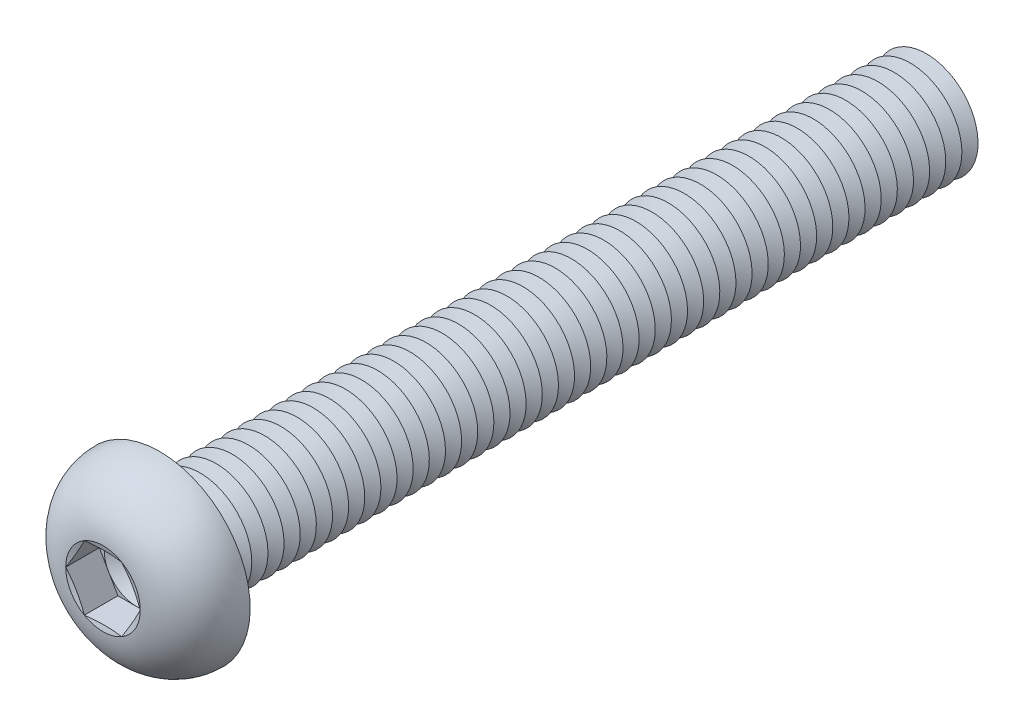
ISO-10303-21;
HEADER;
FILE_DESCRIPTION(('STEP AP214'),'2;1');
FILE_NAME('part.step','',(''),(''),'','','');
FILE_SCHEMA(('AUTOMOTIVE_DESIGN { 1 0 10303 214 1 1 1 1 }'));
ENDSEC;
DATA;
#1=APPLICATION_CONTEXT('core data for automotive mechanical design processes');
#2=APPLICATION_PROTOCOL_DEFINITION('international standard','automotive_design',2000,#1);
#3=PRODUCT_CONTEXT('',#1,'mechanical');
#4=PRODUCT('Part','Part','',(#3));
#5=PRODUCT_RELATED_PRODUCT_CATEGORY('part','',(#4));
#6=PRODUCT_DEFINITION_FORMATION('','',#4);
#7=PRODUCT_DEFINITION_CONTEXT('part definition',#1,'design');
#8=PRODUCT_DEFINITION('design','',#6,#7);
#9=PRODUCT_DEFINITION_SHAPE('','',#8);
#10=(LENGTH_UNIT() NAMED_UNIT(*) SI_UNIT(.MILLI.,.METRE.));
#11=(NAMED_UNIT(*) PLANE_ANGLE_UNIT() SI_UNIT($,.RADIAN.));
#12=(NAMED_UNIT(*) SI_UNIT($,.STERADIAN.) SOLID_ANGLE_UNIT());
#13=UNCERTAINTY_MEASURE_WITH_UNIT(LENGTH_MEASURE(1.E-05),#10,'distance_accuracy_value','');
#14=(GEOMETRIC_REPRESENTATION_CONTEXT(3) GLOBAL_UNCERTAINTY_ASSIGNED_CONTEXT((#13)) GLOBAL_UNIT_ASSIGNED_CONTEXT((#10,
#11,#12)) REPRESENTATION_CONTEXT('',''));
#15=CARTESIAN_POINT('',(0.,0.,0.));
#16=DIRECTION('',(0.,0.,1.));
#17=DIRECTION('',(1.,0.,0.));
#18=AXIS2_PLACEMENT_3D('',#15,#16,#17);
#19=CARTESIAN_POINT('',(0.,0.,1.8));
#20=DIRECTION('',(0.,0.,1.));
#21=DIRECTION('',(1.,0.,0.));
#22=AXIS2_PLACEMENT_3D('',#19,#20,#21);
#23=PLANE('',#22);
#24=CARTESIAN_POINT('',(0.,0.,1.8));
#25=DIRECTION('',(0.,0.,1.));
#26=DIRECTION('',(1.,0.,0.));
#27=AXIS2_PLACEMENT_3D('',#24,#25,#26);
#28=CIRCLE('',#27,2.49999883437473);
#29=CARTESIAN_POINT('',(2.1650625,1.24999941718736,1.8));
#30=VERTEX_POINT('',#29);
#31=CARTESIAN_POINT('',(0.,2.49999883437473,1.8));
#32=VERTEX_POINT('',#31);
#33=EDGE_CURVE('E118',#30,#32,#28,.T.);
#34=ORIENTED_EDGE('',*,*,#33,.F.);
#35=DIRECTION('',(-0.5,0.866025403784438,0.));
#36=VECTOR('',#35,1.);
#37=CARTESIAN_POINT('',(2.88675,0.,1.8));
#38=LINE('',#37,#36);
#39=CARTESIAN_POINT('',(1.443375,2.49999883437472,1.8));
#40=VERTEX_POINT('',#39);
#41=EDGE_CURVE('E125',#30,#40,#38,.T.);
#42=ORIENTED_EDGE('',*,*,#41,.T.);
#43=DIRECTION('',(-1.,0.,0.));
#44=VECTOR('',#43,1.);
#45=CARTESIAN_POINT('',(1.443375,2.49999883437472,1.8));
#46=LINE('',#45,#44);
#47=EDGE_CURVE('E136',#40,#32,#46,.T.);
#48=ORIENTED_EDGE('',*,*,#47,.T.);
#49=EDGE_LOOP('',(#34,#42,#48));
#50=FACE_BOUND('',#49,.T.);
#51=ADVANCED_FACE('F39',(#50),#23,.T.);
#52=CARTESIAN_POINT('',(0.,0.,1.8));
#53=DIRECTION('',(0.,0.,1.));
#54=DIRECTION('',(1.,0.,0.));
#55=AXIS2_PLACEMENT_3D('',#52,#53,#54);
#56=CIRCLE('',#55,2.49999883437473);
#57=CARTESIAN_POINT('',(-2.1650625,1.24999941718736,1.8));
#58=VERTEX_POINT('',#57);
#59=EDGE_CURVE('E11',#32,#58,#56,.T.);
#60=ORIENTED_EDGE('',*,*,#59,.F.);
#61=CARTESIAN_POINT('',(-1.443375,2.49999883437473,1.8));
#62=VERTEX_POINT('',#61);
#63=EDGE_CURVE('E131',#32,#62,#46,.T.);
#64=ORIENTED_EDGE('',*,*,#63,.T.);
#65=DIRECTION('',(-0.5,-0.866025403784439,0.));
#66=VECTOR('',#65,1.);
#67=CARTESIAN_POINT('',(-1.443375,2.49999883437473,1.8));
#68=LINE('',#67,#66);
#69=EDGE_CURVE('E134',#62,#58,#68,.T.);
#70=ORIENTED_EDGE('',*,*,#69,.T.);
#71=EDGE_LOOP('',(#60,#64,#70));
#72=FACE_BOUND('',#71,.T.);
#73=ADVANCED_FACE('F130',(#72),#23,.T.);
#74=CARTESIAN_POINT('',(-2.1650625,-1.24999941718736,1.8));
#75=VERTEX_POINT('',#74);
#76=EDGE_CURVE('E49',#58,#75,#56,.T.);
#77=ORIENTED_EDGE('',*,*,#76,.F.);
#78=CARTESIAN_POINT('',(-2.88675,0.,1.8));
#79=VERTEX_POINT('',#78);
#80=EDGE_CURVE('E143',#58,#79,#68,.T.);
#81=ORIENTED_EDGE('',*,*,#80,.T.);
#82=DIRECTION('',(0.5,-0.866025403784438,0.));
#83=VECTOR('',#82,1.);
#84=CARTESIAN_POINT('',(-2.88675,0.,1.8));
#85=LINE('',#84,#83);
#86=EDGE_CURVE('E152',#79,#75,#85,.T.);
#87=ORIENTED_EDGE('',*,*,#86,.T.);
#88=EDGE_LOOP('',(#77,#81,#87));
#89=FACE_BOUND('',#88,.T.);
#90=ADVANCED_FACE('F650',(#89),#23,.T.);
#91=CARTESIAN_POINT('',(0.,-2.49999883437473,1.8));
#92=VERTEX_POINT('',#91);
#93=EDGE_CURVE('E634',#75,#92,#56,.T.);
#94=ORIENTED_EDGE('',*,*,#93,.F.);
#95=CARTESIAN_POINT('',(-1.443375,-2.49999883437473,1.8));
#96=VERTEX_POINT('',#95);
#97=EDGE_CURVE('E151',#75,#96,#85,.T.);
#98=ORIENTED_EDGE('',*,*,#97,.T.);
#99=DIRECTION('',(1.,0.,0.));
#100=VECTOR('',#99,1.);
#101=CARTESIAN_POINT('',(-1.443375,-2.49999883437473,1.8));
#102=LINE('',#101,#100);
#103=EDGE_CURVE('E157',#96,#92,#102,.T.);
#104=ORIENTED_EDGE('',*,*,#103,.T.);
#105=EDGE_LOOP('',(#94,#98,#104));
#106=FACE_BOUND('',#105,.T.);
#107=ADVANCED_FACE('F643',(#106),#23,.T.);
#108=CARTESIAN_POINT('',(2.1650625,-1.24999941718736,1.8));
#109=VERTEX_POINT('',#108);
#110=EDGE_CURVE('E56',#92,#109,#56,.T.);
#111=ORIENTED_EDGE('',*,*,#110,.F.);
#112=CARTESIAN_POINT('',(1.443375,-2.49999883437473,1.8));
#113=VERTEX_POINT('',#112);
#114=EDGE_CURVE('E156',#92,#113,#102,.T.);
#115=ORIENTED_EDGE('',*,*,#114,.T.);
#116=DIRECTION('',(0.5,0.866025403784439,0.));
#117=VECTOR('',#116,1.);
#118=CARTESIAN_POINT('',(1.443375,-2.49999883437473,1.8));
#119=LINE('',#118,#117);
#120=EDGE_CURVE('E162',#113,#109,#119,.T.);
#121=ORIENTED_EDGE('',*,*,#120,.T.);
#122=EDGE_LOOP('',(#111,#115,#121));
#123=FACE_BOUND('',#122,.T.);
#124=ADVANCED_FACE('F721',(#123),#23,.T.);
#125=CARTESIAN_POINT('',(0.,0.,4.4));
#126=DIRECTION('',(0.,0.,1.));
#127=DIRECTION('',(0.,-1.,0.));
#128=AXIS2_PLACEMENT_3D('',#125,#126,#127);
#129=CONICAL_SURFACE('',#128,2.88675,1.30899693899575);
#130=CARTESIAN_POINT('',(2.88686547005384,-0.000200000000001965,4.40003094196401));
#131=CARTESIAN_POINT('',(2.82691617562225,0.103635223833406,4.3839595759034));
#132=CARTESIAN_POINT('',(2.76685817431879,0.20765873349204,4.36936933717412));
#133=CARTESIAN_POINT('',(2.64653003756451,0.416073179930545,4.3437355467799));
#134=CARTESIAN_POINT('',(2.58625982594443,0.520464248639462,4.33269343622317));
#135=CARTESIAN_POINT('',(2.46587274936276,0.72898078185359,4.31480063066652));
#136=CARTESIAN_POINT('',(2.40575669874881,0.833104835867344,4.3079285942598));
#137=CARTESIAN_POINT('',(2.28544792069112,1.04148575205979,4.29871388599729));
#138=CARTESIAN_POINT('',(2.22525521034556,1.14574258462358,4.29637033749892));
#139=CARTESIAN_POINT('',(2.10486978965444,1.35425624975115,4.29637033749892));
#140=CARTESIAN_POINT('',(2.04467707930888,1.45851308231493,4.29871388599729));
#141=CARTESIAN_POINT('',(1.92436830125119,1.66689399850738,4.3079285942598));
#142=CARTESIAN_POINT('',(1.86425225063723,1.77101805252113,4.31480063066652));
#143=CARTESIAN_POINT('',(1.74386517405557,1.97953458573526,4.33269343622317));
#144=CARTESIAN_POINT('',(1.68359496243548,2.08392565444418,4.3437355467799));
#145=CARTESIAN_POINT('',(1.56326682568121,2.29234010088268,4.36936933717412));
#146=CARTESIAN_POINT('',(1.50320882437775,2.39636361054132,4.3839595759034));
#147=CARTESIAN_POINT('',(1.44325952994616,2.50019883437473,4.40003094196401));
#148=B_SPLINE_CURVE_WITH_KNOTS('',3,(#130,#131,#132,#133,#134,#135,#136,#137,#138,#139,#140,
#141,#142,#143,#144,#145,#146,#147),.UNSPECIFIED.,.F.,.F.,(4,2,2,2,2,2,2,2,4),(0.,
0.362931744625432,0.726010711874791,1.08721550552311,1.44835036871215,1.80948523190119,
2.17069002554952,2.53376899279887,2.89670073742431),.UNSPECIFIED.);
#149=CARTESIAN_POINT('',(2.88675,0.,4.4));
#150=VERTEX_POINT('',#149);
#151=CARTESIAN_POINT('',(1.443375,2.49999883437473,4.4));
#152=VERTEX_POINT('',#151);
#153=EDGE_CURVE('E220',#150,#152,#148,.T.);
#154=ORIENTED_EDGE('',*,*,#153,.F.);
#155=CARTESIAN_POINT('',(0.,0.,4.4));
#156=DIRECTION('',(0.,0.,-1.));
#157=DIRECTION('',(0.,1.,0.));
#158=AXIS2_PLACEMENT_3D('',#155,#156,#157);
#159=CIRCLE('',#158,2.88675);
#160=EDGE_CURVE('E619',#152,#150,#159,.T.);
#161=ORIENTED_EDGE('',*,*,#160,.F.);
#162=EDGE_LOOP('',(#154,#161));
#163=FACE_BOUND('',#162,.T.);
#164=ADVANCED_FACE('F725',(#163),#129,.F.);
#165=CARTESIAN_POINT('',(1.44325952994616,-2.50019883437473,4.40003094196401));
#166=CARTESIAN_POINT('',(1.50320882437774,-2.39636361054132,4.3839595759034));
#167=CARTESIAN_POINT('',(1.56326682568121,-2.29234010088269,4.36936933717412));
#168=CARTESIAN_POINT('',(1.68359496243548,-2.08392565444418,4.3437355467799));
#169=CARTESIAN_POINT('',(1.74386517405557,-1.97953458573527,4.33269343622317));
#170=CARTESIAN_POINT('',(1.86425225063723,-1.77101805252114,4.31480063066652));
#171=CARTESIAN_POINT('',(1.92436830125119,-1.66689399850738,4.3079285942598));
#172=CARTESIAN_POINT('',(2.04467707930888,-1.45851308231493,4.29871388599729));
#173=CARTESIAN_POINT('',(2.10486978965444,-1.35425624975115,4.29637033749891));
#174=CARTESIAN_POINT('',(2.22525521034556,-1.14574258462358,4.29637033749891));
#175=CARTESIAN_POINT('',(2.28544792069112,-1.0414857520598,4.29871388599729));
#176=CARTESIAN_POINT('',(2.40575669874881,-0.833104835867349,4.3079285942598));
#177=CARTESIAN_POINT('',(2.46587274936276,-0.728980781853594,4.31480063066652));
#178=CARTESIAN_POINT('',(2.58625982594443,-0.520464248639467,4.33269343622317));
#179=CARTESIAN_POINT('',(2.64653003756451,-0.41607317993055,4.3437355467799));
#180=CARTESIAN_POINT('',(2.76685817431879,-0.207658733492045,4.36936933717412));
#181=CARTESIAN_POINT('',(2.82691617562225,-0.103635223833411,4.3839595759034));
#182=CARTESIAN_POINT('',(2.88686547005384,0.000199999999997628,4.40003094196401));
#183=B_SPLINE_CURVE_WITH_KNOTS('',3,(#165,#166,#167,#168,#169,#170,#171,#172,#173,#174,#175,
#176,#177,#178,#179,#180,#181,#182),.UNSPECIFIED.,.F.,.F.,(4,2,2,2,2,2,2,2,4),(0.,
0.362931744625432,0.726010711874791,1.08721550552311,1.44835036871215,1.80948523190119,
2.17069002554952,2.53376899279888,2.89670073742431),.UNSPECIFIED.);
#184=CARTESIAN_POINT('',(1.443375,-2.49999883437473,4.4));
#185=VERTEX_POINT('',#184);
#186=EDGE_CURVE('E229',#185,#150,#183,.T.);
#187=ORIENTED_EDGE('',*,*,#186,.F.);
#188=EDGE_CURVE('E624',#150,#185,#159,.T.);
#189=ORIENTED_EDGE('',*,*,#188,.F.);
#190=EDGE_LOOP('',(#187,#189));
#191=FACE_BOUND('',#190,.T.);
#192=ADVANCED_FACE('F686',(#191),#129,.F.);
#193=CARTESIAN_POINT('',(-4.35611719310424,-2.49999883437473,4.97227902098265));
#194=CARTESIAN_POINT('',(-4.25066509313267,-2.49999883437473,4.94777440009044));
#195=CARTESIAN_POINT('',(-4.14516541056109,-2.49999883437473,4.92347459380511));
#196=CARTESIAN_POINT('',(-3.93405094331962,-2.49999883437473,4.87537247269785));
#197=CARTESIAN_POINT('',(-3.82843615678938,-2.49999883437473,4.85157016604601));
#198=CARTESIAN_POINT('',(-3.5113534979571,-2.49999883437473,4.78103338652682));
#199=CARTESIAN_POINT('',(-3.29968815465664,-2.49999883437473,4.73517861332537));
#200=CARTESIAN_POINT('',(-2.87365524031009,-2.49999883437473,4.6464558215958));
#201=CARTESIAN_POINT('',(-2.65928093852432,-2.49999883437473,4.60361983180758));
#202=CARTESIAN_POINT('',(-2.22952626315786,-2.49999883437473,4.52311285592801));
#203=CARTESIAN_POINT('',(-2.01414580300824,-2.49999883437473,4.48544232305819));
#204=CARTESIAN_POINT('',(-1.58798319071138,-2.49999883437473,4.41876559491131));
#205=CARTESIAN_POINT('',(-1.37723418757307,-2.49999883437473,4.38955265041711));
#206=CARTESIAN_POINT('',(-0.95453034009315,-2.49999883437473,4.34171384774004));
#207=CARTESIAN_POINT('',(-0.742575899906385,-2.49999883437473,4.32308463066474));
#208=CARTESIAN_POINT('',(-0.424544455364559,-2.49999883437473,4.3053914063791));
#209=CARTESIAN_POINT('',(-0.318745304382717,-2.49999883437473,4.30120018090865));
#210=CARTESIAN_POINT('',(-0.107062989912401,-2.49999883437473,4.29638997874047));
#211=CARTESIAN_POINT('',(-0.00117982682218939,-2.49999883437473,4.29577098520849));
#212=CARTESIAN_POINT('',(0.210552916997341,-2.49999883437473,4.29814378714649));
#213=CARTESIAN_POINT('',(0.316402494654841,-2.49999883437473,4.30113585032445));
#214=CARTESIAN_POINT('',(0.527944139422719,-2.49999883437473,4.31057322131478));
#215=CARTESIAN_POINT('',(0.63363620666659,-2.49999883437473,4.31701852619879));
#216=CARTESIAN_POINT('',(0.890304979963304,-2.49999883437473,4.33652018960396));
#217=CARTESIAN_POINT('',(1.0411561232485,-2.49999883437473,4.35122885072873));
#218=CARTESIAN_POINT('',(1.34222474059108,-2.49999883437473,4.38593609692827));
#219=CARTESIAN_POINT('',(1.49244223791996,-2.49999883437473,4.40593448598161));
#220=CARTESIAN_POINT('',(1.79273634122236,-2.49999883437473,4.45011321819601));
#221=CARTESIAN_POINT('',(1.94281100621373,-2.49999883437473,4.47430656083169));
#222=CARTESIAN_POINT('',(2.24242097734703,-2.49999883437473,4.52583552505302));
#223=CARTESIAN_POINT('',(2.39195625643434,-2.49999883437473,4.55317130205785));
#224=CARTESIAN_POINT('',(2.69364402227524,-2.49999883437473,4.61079781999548));
#225=CARTESIAN_POINT('',(2.8457870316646,-2.49999883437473,4.64113779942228));
#226=CARTESIAN_POINT('',(3.14969016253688,-2.49999883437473,4.70367638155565));
#227=CARTESIAN_POINT('',(3.30145027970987,-2.49999883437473,4.73587500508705));
#228=CARTESIAN_POINT('',(3.60383766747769,-2.49999883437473,4.80150275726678));
#229=CARTESIAN_POINT('',(3.75446660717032,-2.49999883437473,4.83492423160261));
#230=CARTESIAN_POINT('',(4.05546753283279,-2.49999883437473,4.90285814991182));
#231=CARTESIAN_POINT('',(4.2058395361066,-2.49999883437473,4.93737051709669));
#232=CARTESIAN_POINT('',(4.35611719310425,-2.49999883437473,4.97227902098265));
#233=B_SPLINE_CURVE_WITH_KNOTS('',3,(#193,#194,#195,#196,#197,#198,#199,#200,#201,#202,#203,
#204,#205,#206,#207,#208,#209,#210,#211,#212,#213,#214,#215,#216,#217,#218,#219,#220,#221,#222,
#223,#224,#225,#226,#227,#228,#229,#230,#231,#232),.UNSPECIFIED.,.F.,.F.,(4,2,2,2,2,2,2,2,2,2,2,
2,2,2,2,2,2,2,2,4),(0.,0.324785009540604,0.649575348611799,1.29928181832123,1.95507889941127,
2.61093348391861,3.24905289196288,3.88696967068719,4.204563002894,4.5221548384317,
4.83977022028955,5.15738533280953,5.61196030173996,6.06651842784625,6.52251118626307,
6.97852650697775,7.44392737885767,7.90933346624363,8.37220553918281,8.83504510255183),.UNSPECIFIED.);
#234=CARTESIAN_POINT('',(-1.443375,-2.49999883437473,4.4));
#235=VERTEX_POINT('',#234);
#236=EDGE_CURVE('E664',#235,#185,#233,.T.);
#237=ORIENTED_EDGE('',*,*,#236,.F.);
#238=EDGE_CURVE('E677',#185,#235,#159,.T.);
#239=ORIENTED_EDGE('',*,*,#238,.F.);
#240=EDGE_LOOP('',(#237,#239));
#241=FACE_BOUND('',#240,.T.);
#242=ADVANCED_FACE('F692',(#241),#129,.F.);
#243=CARTESIAN_POINT('',(-2.88686547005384,0.000199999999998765,4.40003094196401));
#244=CARTESIAN_POINT('',(-2.82691617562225,-0.10363522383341,4.3839595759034));
#245=CARTESIAN_POINT('',(-2.76685817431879,-0.207658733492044,4.36936933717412));
#246=CARTESIAN_POINT('',(-2.64653003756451,-0.416073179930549,4.3437355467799));
#247=CARTESIAN_POINT('',(-2.58625982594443,-0.520464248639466,4.33269343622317));
#248=CARTESIAN_POINT('',(-2.46587274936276,-0.728980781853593,4.31480063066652));
#249=CARTESIAN_POINT('',(-2.40575669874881,-0.833104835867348,4.3079285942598));
#250=CARTESIAN_POINT('',(-2.28544792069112,-1.0414857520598,4.29871388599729));
#251=CARTESIAN_POINT('',(-2.22525521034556,-1.14574258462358,4.29637033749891));
#252=CARTESIAN_POINT('',(-2.10486978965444,-1.35425624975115,4.29637033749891));
#253=CARTESIAN_POINT('',(-2.04467707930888,-1.45851308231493,4.29871388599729));
#254=CARTESIAN_POINT('',(-1.92436830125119,-1.66689399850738,4.3079285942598));
#255=CARTESIAN_POINT('',(-1.86425225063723,-1.77101805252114,4.31480063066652));
#256=CARTESIAN_POINT('',(-1.74386517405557,-1.97953458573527,4.33269343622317));
#257=CARTESIAN_POINT('',(-1.68359496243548,-2.08392565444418,4.3437355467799));
#258=CARTESIAN_POINT('',(-1.56326682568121,-2.29234010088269,4.36936933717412));
#259=CARTESIAN_POINT('',(-1.50320882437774,-2.39636361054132,4.3839595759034));
#260=CARTESIAN_POINT('',(-1.44325952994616,-2.50019883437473,4.40003094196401));
#261=B_SPLINE_CURVE_WITH_KNOTS('',3,(#243,#244,#245,#246,#247,#248,#249,#250,#251,#252,#253,
#254,#255,#256,#257,#258,#259,#260),.UNSPECIFIED.,.F.,.F.,(4,2,2,2,2,2,2,2,4),(0.,
0.362931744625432,0.726010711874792,1.08721550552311,1.44835036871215,1.8094852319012,
2.17069002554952,2.53376899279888,2.89670073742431),.UNSPECIFIED.);
#262=CARTESIAN_POINT('',(-2.88675,0.,4.4));
#263=VERTEX_POINT('',#262);
#264=EDGE_CURVE('E655',#263,#235,#261,.T.);
#265=ORIENTED_EDGE('',*,*,#264,.F.);
#266=EDGE_CURVE('E661',#235,#263,#159,.T.);
#267=ORIENTED_EDGE('',*,*,#266,.F.);
#268=EDGE_LOOP('',(#265,#267));
#269=FACE_BOUND('',#268,.T.);
#270=ADVANCED_FACE('F659',(#269),#129,.F.);
#271=CARTESIAN_POINT('',(-1.44325952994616,2.50019883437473,4.40003094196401));
#272=CARTESIAN_POINT('',(-1.50320882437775,2.39636361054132,4.3839595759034));
#273=CARTESIAN_POINT('',(-1.56326682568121,2.29234010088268,4.36936933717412));
#274=CARTESIAN_POINT('',(-1.68359496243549,2.08392565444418,4.3437355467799));
#275=CARTESIAN_POINT('',(-1.74386517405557,1.97953458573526,4.33269343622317));
#276=CARTESIAN_POINT('',(-1.86425225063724,1.77101805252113,4.31480063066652));
#277=CARTESIAN_POINT('',(-1.92436830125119,1.66689399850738,4.3079285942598));
#278=CARTESIAN_POINT('',(-2.04467707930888,1.45851308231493,4.29871388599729));
#279=CARTESIAN_POINT('',(-2.10486978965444,1.35425624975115,4.29637033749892));
#280=CARTESIAN_POINT('',(-2.22525521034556,1.14574258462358,4.29637033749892));
#281=CARTESIAN_POINT('',(-2.28544792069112,1.04148575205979,4.29871388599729));
#282=CARTESIAN_POINT('',(-2.40575669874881,0.833104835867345,4.3079285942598));
#283=CARTESIAN_POINT('',(-2.46587274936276,0.72898078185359,4.31480063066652));
#284=CARTESIAN_POINT('',(-2.58625982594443,0.520464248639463,4.33269343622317));
#285=CARTESIAN_POINT('',(-2.64653003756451,0.416073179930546,4.3437355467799));
#286=CARTESIAN_POINT('',(-2.76685817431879,0.20765873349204,4.36936933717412));
#287=CARTESIAN_POINT('',(-2.82691617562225,0.103635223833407,4.3839595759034));
#288=CARTESIAN_POINT('',(-2.88686547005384,-0.000200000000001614,4.40003094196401));
#289=B_SPLINE_CURVE_WITH_KNOTS('',3,(#271,#272,#273,#274,#275,#276,#277,#278,#279,#280,#281,
#282,#283,#284,#285,#286,#287,#288),.UNSPECIFIED.,.F.,.F.,(4,2,2,2,2,2,2,2,4),(0.,
0.362931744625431,0.726010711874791,1.08721550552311,1.44835036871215,1.80948523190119,
2.17069002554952,2.53376899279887,2.89670073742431),.UNSPECIFIED.);
#290=CARTESIAN_POINT('',(-1.443375,2.49999883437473,4.4));
#291=VERTEX_POINT('',#290);
#292=EDGE_CURVE('E194',#291,#263,#289,.T.);
#293=ORIENTED_EDGE('',*,*,#292,.F.);
#294=EDGE_CURVE('E667',#263,#291,#159,.T.);
#295=ORIENTED_EDGE('',*,*,#294,.F.);
#296=EDGE_LOOP('',(#293,#295));
#297=FACE_BOUND('',#296,.T.);
#298=ADVANCED_FACE('F668',(#297),#129,.F.);
#299=CARTESIAN_POINT('',(0.,0.,-55.625));
#300=DIRECTION('',(0.,0.,1.));
#301=DIRECTION('',(0.,-1.,0.));
#302=AXIS2_PLACEMENT_3D('',#299,#300,#301);
#303=CONICAL_SURFACE('',#302,3.99999999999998,1.0471975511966);
#304=CARTESIAN_POINT('',(0.,0.,-56.25));
#305=DIRECTION('',(0.,0.,1.));
#306=DIRECTION('',(0.,-1.,0.));
#307=AXIS2_PLACEMENT_3D('',#304,#305,#306);
#308=CIRCLE('',#307,2.91746824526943);
#309=CARTESIAN_POINT('',(0.,-2.9174682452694,-56.25));
#310=VERTEX_POINT('',#309);
#311=EDGE_CURVE('E590',#310,#310,#308,.T.);
#312=ORIENTED_EDGE('',*,*,#311,.T.);
#313=EDGE_LOOP('',(#312));
#314=FACE_BOUND('',#313,.T.);
#315=CARTESIAN_POINT('',(0.,0.,-55.625));
#316=DIRECTION('',(0.,0.,1.));
#317=DIRECTION('',(0.,-1.,0.));
#318=AXIS2_PLACEMENT_3D('',#315,#316,#317);
#319=CIRCLE('',#318,3.99999999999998);
#320=CARTESIAN_POINT('',(0.,-3.99999999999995,-55.625));
#321=VERTEX_POINT('',#320);
#322=EDGE_CURVE('E586',#321,#321,#319,.T.);
#323=ORIENTED_EDGE('',*,*,#322,.F.);
#324=EDGE_LOOP('',(#323));
#325=FACE_BOUND('',#324,.T.);
#326=ADVANCED_FACE('F753',(#314,#325),#303,.T.);
#327=CARTESIAN_POINT('',(0.,0.,-56.25));
#328=DIRECTION('',(0.,0.,-1.));
#329=DIRECTION('',(0.,1.,0.));
#330=AXIS2_PLACEMENT_3D('',#327,#328,#329);
#331=CONICAL_SURFACE('',#330,2.91746824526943,1.0471975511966);
#332=CARTESIAN_POINT('',(0.,0.,-56.875));
#333=DIRECTION('',(0.,0.,1.));
#334=DIRECTION('',(0.,-1.,0.));
#335=AXIS2_PLACEMENT_3D('',#332,#333,#334);
#336=CIRCLE('',#335,3.99999999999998);
#337=CARTESIAN_POINT('',(0.,-3.99999999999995,-56.875));
#338=VERTEX_POINT('',#337);
#339=EDGE_CURVE('E594',#338,#338,#336,.T.);
#340=ORIENTED_EDGE('',*,*,#339,.T.);
#341=EDGE_LOOP('',(#340));
#342=FACE_BOUND('',#341,.T.);
#343=ORIENTED_EDGE('',*,*,#311,.F.);
#344=EDGE_LOOP('',(#343));
#345=FACE_BOUND('',#344,.T.);
#346=ADVANCED_FACE('F758',(#342,#345),#331,.T.);
#347=CARTESIAN_POINT('',(0.,3.99999999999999,-60.));
#348=DIRECTION('',(0.,0.,-1.));
#349=DIRECTION('',(0.,1.,0.));
#350=AXIS2_PLACEMENT_3D('',#347,#348,#349);
#351=PLANE('',#350);
#352=CARTESIAN_POINT('',(0.,0.,-60.));
#353=DIRECTION('',(0.,0.,1.));
#354=DIRECTION('',(0.,-1.,0.));
#355=AXIS2_PLACEMENT_3D('',#352,#353,#354);
#356=CIRCLE('',#355,2.91746824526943);
#357=CARTESIAN_POINT('',(0.,-2.9174682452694,-60.));
#358=VERTEX_POINT('',#357);
#359=EDGE_CURVE('E614',#358,#358,#356,.T.);
#360=ORIENTED_EDGE('',*,*,#359,.F.);
#361=EDGE_LOOP('',(#360));
#362=FACE_BOUND('',#361,.T.);
#363=ADVANCED_FACE('F925',(#362),#351,.T.);
#364=CARTESIAN_POINT('',(0.,0.,-59.375));
#365=DIRECTION('',(0.,0.,1.));
#366=DIRECTION('',(0.,-1.,0.));
#367=AXIS2_PLACEMENT_3D('',#364,#365,#366);
#368=CONICAL_SURFACE('',#367,3.99999999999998,1.0471975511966);
#369=ORIENTED_EDGE('',*,*,#359,.T.);
#370=EDGE_LOOP('',(#369));
#371=FACE_BOUND('',#370,.T.);
#372=CARTESIAN_POINT('',(0.,0.,-59.375));
#373=DIRECTION('',(0.,0.,1.));
#374=DIRECTION('',(0.,-1.,0.));
#375=AXIS2_PLACEMENT_3D('',#372,#373,#374);
#376=CIRCLE('',#375,3.99999999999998);
#377=CARTESIAN_POINT('',(0.,-3.99999999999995,-59.375));
#378=VERTEX_POINT('',#377);
#379=EDGE_CURVE('E610',#378,#378,#376,.T.);
#380=ORIENTED_EDGE('',*,*,#379,.F.);
#381=EDGE_LOOP('',(#380));
#382=FACE_BOUND('',#381,.T.);
#383=ADVANCED_FACE('F918',(#371,#382),#368,.T.);
#384=CARTESIAN_POINT('',(0.,0.,-58.75));
#385=DIRECTION('',(0.,0.,-1.));
#386=DIRECTION('',(0.,1.,0.));
#387=AXIS2_PLACEMENT_3D('',#384,#385,#386);
#388=CONICAL_SURFACE('',#387,2.91746824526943,1.0471975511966);
#389=ORIENTED_EDGE('',*,*,#379,.T.);
#390=EDGE_LOOP('',(#389));
#391=FACE_BOUND('',#390,.T.);
#392=CARTESIAN_POINT('',(0.,0.,-58.75));
#393=DIRECTION('',(0.,0.,1.));
#394=DIRECTION('',(0.,-1.,0.));
#395=AXIS2_PLACEMENT_3D('',#392,#393,#394);
#396=CIRCLE('',#395,2.91746824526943);
#397=CARTESIAN_POINT('',(0.,-2.9174682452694,-58.75));
#398=VERTEX_POINT('',#397);
#399=EDGE_CURVE('E606',#398,#398,#396,.T.);
#400=ORIENTED_EDGE('',*,*,#399,.F.);
#401=EDGE_LOOP('',(#400));
#402=FACE_BOUND('',#401,.T.);
#403=ADVANCED_FACE('F924',(#391,#402),#388,.T.);
#404=CARTESIAN_POINT('',(0.,0.,-58.125));
#405=DIRECTION('',(0.,0.,1.));
#406=DIRECTION('',(0.,-1.,0.));
#407=AXIS2_PLACEMENT_3D('',#404,#405,#406);
#408=CONICAL_SURFACE('',#407,3.99999999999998,1.0471975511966);
#409=ORIENTED_EDGE('',*,*,#399,.T.);
#410=EDGE_LOOP('',(#409));
#411=FACE_BOUND('',#410,.T.);
#412=CARTESIAN_POINT('',(0.,0.,-58.125));
#413=DIRECTION('',(0.,0.,1.));
#414=DIRECTION('',(0.,-1.,0.));
#415=AXIS2_PLACEMENT_3D('',#412,#413,#414);
#416=CIRCLE('',#415,3.99999999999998);
#417=CARTESIAN_POINT('',(0.,-3.99999999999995,-58.125));
#418=VERTEX_POINT('',#417);
#419=EDGE_CURVE('E602',#418,#418,#416,.T.);
#420=ORIENTED_EDGE('',*,*,#419,.F.);
#421=EDGE_LOOP('',(#420));
#422=FACE_BOUND('',#421,.T.);
#423=ADVANCED_FACE('F956',(#411,#422),#408,.T.);
#424=CARTESIAN_POINT('',(0.,0.,-57.5));
#425=DIRECTION('',(0.,0.,-1.));
#426=DIRECTION('',(0.,1.,0.));
#427=AXIS2_PLACEMENT_3D('',#424,#425,#426);
#428=CONICAL_SURFACE('',#427,2.91746824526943,1.0471975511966);
#429=ORIENTED_EDGE('',*,*,#419,.T.);
#430=EDGE_LOOP('',(#429));
#431=FACE_BOUND('',#430,.T.);
#432=CARTESIAN_POINT('',(0.,0.,-57.5));
#433=DIRECTION('',(0.,0.,1.));
#434=DIRECTION('',(0.,-1.,0.));
#435=AXIS2_PLACEMENT_3D('',#432,#433,#434);
#436=CIRCLE('',#435,2.91746824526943);
#437=CARTESIAN_POINT('',(0.,-2.9174682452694,-57.5));
#438=VERTEX_POINT('',#437);
#439=EDGE_CURVE('E598',#438,#438,#436,.T.);
#440=ORIENTED_EDGE('',*,*,#439,.F.);
#441=EDGE_LOOP('',(#440));
#442=FACE_BOUND('',#441,.T.);
#443=ADVANCED_FACE('F966',(#431,#442),#428,.T.);
#444=CARTESIAN_POINT('',(0.,0.,-56.875));
#445=DIRECTION('',(0.,0.,1.));
#446=DIRECTION('',(0.,-1.,0.));
#447=AXIS2_PLACEMENT_3D('',#444,#445,#446);
#448=CONICAL_SURFACE('',#447,3.99999999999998,1.0471975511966);
#449=ORIENTED_EDGE('',*,*,#439,.T.);
#450=EDGE_LOOP('',(#449));
#451=FACE_BOUND('',#450,.T.);
#452=ORIENTED_EDGE('',*,*,#339,.F.);
#453=EDGE_LOOP('',(#452));
#454=FACE_BOUND('',#453,.T.);
#455=ADVANCED_FACE('F976',(#451,#454),#448,.T.);
#456=CARTESIAN_POINT('',(0.,0.,-54.375));
#457=DIRECTION('',(0.,0.,1.));
#458=DIRECTION('',(0.,-1.,0.));
#459=AXIS2_PLACEMENT_3D('',#456,#457,#458);
#460=CONICAL_SURFACE('',#459,3.99999999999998,1.0471975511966);
#461=CARTESIAN_POINT('',(0.,0.,-55.));
#462=DIRECTION('',(0.,0.,1.));
#463=DIRECTION('',(0.,-1.,0.));
#464=AXIS2_PLACEMENT_3D('',#461,#462,#463);
#465=CIRCLE('',#464,2.91746824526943);
#466=CARTESIAN_POINT('',(0.,-2.9174682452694,-55.));
#467=VERTEX_POINT('',#466);
#468=EDGE_CURVE('E582',#467,#467,#465,.T.);
#469=ORIENTED_EDGE('',*,*,#468,.T.);
#470=EDGE_LOOP('',(#469));
#471=FACE_BOUND('',#470,.T.);
#472=CARTESIAN_POINT('',(0.,0.,-54.375));
#473=DIRECTION('',(0.,0.,1.));
#474=DIRECTION('',(0.,-1.,0.));
#475=AXIS2_PLACEMENT_3D('',#472,#473,#474);
#476=CIRCLE('',#475,3.99999999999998);
#477=CARTESIAN_POINT('',(0.,-3.99999999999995,-54.375));
#478=VERTEX_POINT('',#477);
#479=EDGE_CURVE('E578',#478,#478,#476,.T.);
#480=ORIENTED_EDGE('',*,*,#479,.F.);
#481=EDGE_LOOP('',(#480));
#482=FACE_BOUND('',#481,.T.);
#483=ADVANCED_FACE('F986',(#471,#482),#460,.T.);
#484=CARTESIAN_POINT('',(0.,0.,-55.));
#485=DIRECTION('',(0.,0.,-1.));
#486=DIRECTION('',(0.,1.,0.));
#487=AXIS2_PLACEMENT_3D('',#484,#485,#486);
#488=CONICAL_SURFACE('',#487,2.91746824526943,1.0471975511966);
#489=ORIENTED_EDGE('',*,*,#322,.T.);
#490=EDGE_LOOP('',(#489));
#491=FACE_BOUND('',#490,.T.);
#492=ORIENTED_EDGE('',*,*,#468,.F.);
#493=EDGE_LOOP('',(#492));
#494=FACE_BOUND('',#493,.T.);
#495=ADVANCED_FACE('F996',(#491,#494),#488,.T.);
#496=CARTESIAN_POINT('',(0.,0.,-53.125));
#497=DIRECTION('',(0.,0.,1.));
#498=DIRECTION('',(0.,-1.,0.));
#499=AXIS2_PLACEMENT_3D('',#496,#497,#498);
#500=CONICAL_SURFACE('',#499,3.99999999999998,1.0471975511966);
#501=CARTESIAN_POINT('',(0.,0.,-53.75));
#502=DIRECTION('',(0.,0.,1.));
#503=DIRECTION('',(0.,-1.,0.));
#504=AXIS2_PLACEMENT_3D('',#501,#502,#503);
#505=CIRCLE('',#504,2.91746824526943);
#506=CARTESIAN_POINT('',(0.,-2.9174682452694,-53.75));
#507=VERTEX_POINT('',#506);
#508=EDGE_CURVE('E574',#507,#507,#505,.T.);
#509=ORIENTED_EDGE('',*,*,#508,.T.);
#510=EDGE_LOOP('',(#509));
#511=FACE_BOUND('',#510,.T.);
#512=CARTESIAN_POINT('',(0.,0.,-53.125));
#513=DIRECTION('',(0.,0.,1.));
#514=DIRECTION('',(0.,-1.,0.));
#515=AXIS2_PLACEMENT_3D('',#512,#513,#514);
#516=CIRCLE('',#515,3.99999999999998);
#517=CARTESIAN_POINT('',(0.,-3.99999999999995,-53.125));
#518=VERTEX_POINT('',#517);
#519=EDGE_CURVE('E570',#518,#518,#516,.T.);
#520=ORIENTED_EDGE('',*,*,#519,.F.);
#521=EDGE_LOOP('',(#520));
#522=FACE_BOUND('',#521,.T.);
#523=ADVANCED_FACE('F1006',(#511,#522),#500,.T.);
#524=CARTESIAN_POINT('',(0.,0.,-53.75));
#525=DIRECTION('',(0.,0.,-1.));
#526=DIRECTION('',(0.,1.,0.));
#527=AXIS2_PLACEMENT_3D('',#524,#525,#526);
#528=CONICAL_SURFACE('',#527,2.91746824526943,1.0471975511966);
#529=ORIENTED_EDGE('',*,*,#479,.T.);
#530=EDGE_LOOP('',(#529));
#531=FACE_BOUND('',#530,.T.);
#532=ORIENTED_EDGE('',*,*,#508,.F.);
#533=EDGE_LOOP('',(#532));
#534=FACE_BOUND('',#533,.T.);
#535=ADVANCED_FACE('F1016',(#531,#534),#528,.T.);
#536=CARTESIAN_POINT('',(0.,0.,-51.875));
#537=DIRECTION('',(0.,0.,1.));
#538=DIRECTION('',(0.,-1.,0.));
#539=AXIS2_PLACEMENT_3D('',#536,#537,#538);
#540=CONICAL_SURFACE('',#539,3.99999999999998,1.0471975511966);
#541=CARTESIAN_POINT('',(0.,0.,-52.5));
#542=DIRECTION('',(0.,0.,1.));
#543=DIRECTION('',(0.,-1.,0.));
#544=AXIS2_PLACEMENT_3D('',#541,#542,#543);
#545=CIRCLE('',#544,2.91746824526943);
#546=CARTESIAN_POINT('',(0.,-2.9174682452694,-52.5));
#547=VERTEX_POINT('',#546);
#548=EDGE_CURVE('E566',#547,#547,#545,.T.);
#549=ORIENTED_EDGE('',*,*,#548,.T.);
#550=EDGE_LOOP('',(#549));
#551=FACE_BOUND('',#550,.T.);
#552=CARTESIAN_POINT('',(0.,0.,-51.875));
#553=DIRECTION('',(0.,0.,1.));
#554=DIRECTION('',(0.,-1.,0.));
#555=AXIS2_PLACEMENT_3D('',#552,#553,#554);
#556=CIRCLE('',#555,3.99999999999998);
#557=CARTESIAN_POINT('',(0.,-3.99999999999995,-51.875));
#558=VERTEX_POINT('',#557);
#559=EDGE_CURVE('E562',#558,#558,#556,.T.);
#560=ORIENTED_EDGE('',*,*,#559,.F.);
#561=EDGE_LOOP('',(#560));
#562=FACE_BOUND('',#561,.T.);
#563=ADVANCED_FACE('F1026',(#551,#562),#540,.T.);
#564=CARTESIAN_POINT('',(0.,0.,-52.5));
#565=DIRECTION('',(0.,0.,-1.));
#566=DIRECTION('',(0.,1.,0.));
#567=AXIS2_PLACEMENT_3D('',#564,#565,#566);
#568=CONICAL_SURFACE('',#567,2.91746824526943,1.0471975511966);
#569=ORIENTED_EDGE('',*,*,#519,.T.);
#570=EDGE_LOOP('',(#569));
#571=FACE_BOUND('',#570,.T.);
#572=ORIENTED_EDGE('',*,*,#548,.F.);
#573=EDGE_LOOP('',(#572));
#574=FACE_BOUND('',#573,.T.);
#575=ADVANCED_FACE('F1036',(#571,#574),#568,.T.);
#576=CARTESIAN_POINT('',(0.,0.,-50.625));
#577=DIRECTION('',(0.,0.,1.));
#578=DIRECTION('',(0.,-1.,0.));
#579=AXIS2_PLACEMENT_3D('',#576,#577,#578);
#580=CONICAL_SURFACE('',#579,3.99999999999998,1.0471975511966);
#581=CARTESIAN_POINT('',(0.,0.,-51.25));
#582=DIRECTION('',(0.,0.,1.));
#583=DIRECTION('',(0.,-1.,0.));
#584=AXIS2_PLACEMENT_3D('',#581,#582,#583);
#585=CIRCLE('',#584,2.91746824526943);
#586=CARTESIAN_POINT('',(0.,-2.9174682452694,-51.25));
#587=VERTEX_POINT('',#586);
#588=EDGE_CURVE('E558',#587,#587,#585,.T.);
#589=ORIENTED_EDGE('',*,*,#588,.T.);
#590=EDGE_LOOP('',(#589));
#591=FACE_BOUND('',#590,.T.);
#592=CARTESIAN_POINT('',(0.,0.,-50.625));
#593=DIRECTION('',(0.,0.,1.));
#594=DIRECTION('',(0.,-1.,0.));
#595=AXIS2_PLACEMENT_3D('',#592,#593,#594);
#596=CIRCLE('',#595,3.99999999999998);
#597=CARTESIAN_POINT('',(0.,-3.99999999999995,-50.625));
#598=VERTEX_POINT('',#597);
#599=EDGE_CURVE('E554',#598,#598,#596,.T.);
#600=ORIENTED_EDGE('',*,*,#599,.F.);
#601=EDGE_LOOP('',(#600));
#602=FACE_BOUND('',#601,.T.);
#603=ADVANCED_FACE('F1046',(#591,#602),#580,.T.);
#604=CARTESIAN_POINT('',(0.,0.,-51.25));
#605=DIRECTION('',(0.,0.,-1.));
#606=DIRECTION('',(0.,1.,0.));
#607=AXIS2_PLACEMENT_3D('',#604,#605,#606);
#608=CONICAL_SURFACE('',#607,2.91746824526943,1.0471975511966);
#609=ORIENTED_EDGE('',*,*,#559,.T.);
#610=EDGE_LOOP('',(#609));
#611=FACE_BOUND('',#610,.T.);
#612=ORIENTED_EDGE('',*,*,#588,.F.);
#613=EDGE_LOOP('',(#612));
#614=FACE_BOUND('',#613,.T.);
#615=ADVANCED_FACE('F1056',(#611,#614),#608,.T.);
#616=CARTESIAN_POINT('',(0.,0.,-49.375));
#617=DIRECTION('',(0.,0.,1.));
#618=DIRECTION('',(0.,-1.,0.));
#619=AXIS2_PLACEMENT_3D('',#616,#617,#618);
#620=CONICAL_SURFACE('',#619,3.99999999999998,1.0471975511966);
#621=CARTESIAN_POINT('',(0.,0.,-50.));
#622=DIRECTION('',(0.,0.,1.));
#623=DIRECTION('',(0.,-1.,0.));
#624=AXIS2_PLACEMENT_3D('',#621,#622,#623);
#625=CIRCLE('',#624,2.91746824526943);
#626=CARTESIAN_POINT('',(0.,-2.9174682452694,-50.));
#627=VERTEX_POINT('',#626);
#628=EDGE_CURVE('E551',#627,#627,#625,.T.);
#629=ORIENTED_EDGE('',*,*,#628,.T.);
#630=EDGE_LOOP('',(#629));
#631=FACE_BOUND('',#630,.T.);
#632=CARTESIAN_POINT('',(0.,0.,-49.375));
#633=DIRECTION('',(0.,0.,1.));
#634=DIRECTION('',(0.,-1.,0.));
#635=AXIS2_PLACEMENT_3D('',#632,#633,#634);
#636=CIRCLE('',#635,3.99999999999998);
#637=CARTESIAN_POINT('',(0.,-3.99999999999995,-49.375));
#638=VERTEX_POINT('',#637);
#639=EDGE_CURVE('E547',#638,#638,#636,.T.);
#640=ORIENTED_EDGE('',*,*,#639,.F.);
#641=EDGE_LOOP('',(#640));
#642=FACE_BOUND('',#641,.T.);
#643=ADVANCED_FACE('F1066',(#631,#642),#620,.T.);
#644=CARTESIAN_POINT('',(0.,0.,-50.));
#645=DIRECTION('',(0.,0.,-1.));
#646=DIRECTION('',(0.,1.,0.));
#647=AXIS2_PLACEMENT_3D('',#644,#645,#646);
#648=CONICAL_SURFACE('',#647,2.91746824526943,1.0471975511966);
#649=ORIENTED_EDGE('',*,*,#599,.T.);
#650=EDGE_LOOP('',(#649));
#651=FACE_BOUND('',#650,.T.);
#652=ORIENTED_EDGE('',*,*,#628,.F.);
#653=EDGE_LOOP('',(#652));
#654=FACE_BOUND('',#653,.T.);
#655=ADVANCED_FACE('F1076',(#651,#654),#648,.T.);
#656=CARTESIAN_POINT('',(0.,0.,-48.125));
#657=DIRECTION('',(0.,0.,1.));
#658=DIRECTION('',(0.,-1.,0.));
#659=AXIS2_PLACEMENT_3D('',#656,#657,#658);
#660=CONICAL_SURFACE('',#659,3.99999999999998,1.0471975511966);
#661=CARTESIAN_POINT('',(0.,0.,-48.75));
#662=DIRECTION('',(0.,0.,1.));
#663=DIRECTION('',(0.,-1.,0.));
#664=AXIS2_PLACEMENT_3D('',#661,#662,#663);
#665=CIRCLE('',#664,2.91746824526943);
#666=CARTESIAN_POINT('',(0.,-2.9174682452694,-48.75));
#667=VERTEX_POINT('',#666);
#668=EDGE_CURVE('E543',#667,#667,#665,.T.);
#669=ORIENTED_EDGE('',*,*,#668,.T.);
#670=EDGE_LOOP('',(#669));
#671=FACE_BOUND('',#670,.T.);
#672=CARTESIAN_POINT('',(0.,0.,-48.125));
#673=DIRECTION('',(0.,0.,1.));
#674=DIRECTION('',(0.,-1.,0.));
#675=AXIS2_PLACEMENT_3D('',#672,#673,#674);
#676=CIRCLE('',#675,3.99999999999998);
#677=CARTESIAN_POINT('',(0.,-3.99999999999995,-48.125));
#678=VERTEX_POINT('',#677);
#679=EDGE_CURVE('E539',#678,#678,#676,.T.);
#680=ORIENTED_EDGE('',*,*,#679,.F.);
#681=EDGE_LOOP('',(#680));
#682=FACE_BOUND('',#681,.T.);
#683=ADVANCED_FACE('F1086',(#671,#682),#660,.T.);
#684=CARTESIAN_POINT('',(0.,0.,-48.75));
#685=DIRECTION('',(0.,0.,-1.));
#686=DIRECTION('',(0.,1.,0.));
#687=AXIS2_PLACEMENT_3D('',#684,#685,#686);
#688=CONICAL_SURFACE('',#687,2.91746824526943,1.0471975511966);
#689=ORIENTED_EDGE('',*,*,#639,.T.);
#690=EDGE_LOOP('',(#689));
#691=FACE_BOUND('',#690,.T.);
#692=ORIENTED_EDGE('',*,*,#668,.F.);
#693=EDGE_LOOP('',(#692));
#694=FACE_BOUND('',#693,.T.);
#695=ADVANCED_FACE('F1096',(#691,#694),#688,.T.);
#696=CARTESIAN_POINT('',(0.,0.,-46.875));
#697=DIRECTION('',(0.,0.,1.));
#698=DIRECTION('',(0.,-1.,0.));
#699=AXIS2_PLACEMENT_3D('',#696,#697,#698);
#700=CONICAL_SURFACE('',#699,3.99999999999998,1.0471975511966);
#701=CARTESIAN_POINT('',(0.,0.,-47.5));
#702=DIRECTION('',(0.,0.,1.));
#703=DIRECTION('',(0.,-1.,0.));
#704=AXIS2_PLACEMENT_3D('',#701,#702,#703);
#705=CIRCLE('',#704,2.91746824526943);
#706=CARTESIAN_POINT('',(0.,-2.91746824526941,-47.5));
#707=VERTEX_POINT('',#706);
#708=EDGE_CURVE('E535',#707,#707,#705,.T.);
#709=ORIENTED_EDGE('',*,*,#708,.T.);
#710=EDGE_LOOP('',(#709));
#711=FACE_BOUND('',#710,.T.);
#712=CARTESIAN_POINT('',(0.,0.,-46.875));
#713=DIRECTION('',(0.,0.,1.));
#714=DIRECTION('',(0.,-1.,0.));
#715=AXIS2_PLACEMENT_3D('',#712,#713,#714);
#716=CIRCLE('',#715,3.99999999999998);
#717=CARTESIAN_POINT('',(0.,-3.99999999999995,-46.875));
#718=VERTEX_POINT('',#717);
#719=EDGE_CURVE('E531',#718,#718,#716,.T.);
#720=ORIENTED_EDGE('',*,*,#719,.F.);
#721=EDGE_LOOP('',(#720));
#722=FACE_BOUND('',#721,.T.);
#723=ADVANCED_FACE('F1106',(#711,#722),#700,.T.);
#724=CARTESIAN_POINT('',(0.,0.,-47.5));
#725=DIRECTION('',(0.,0.,-1.));
#726=DIRECTION('',(0.,1.,0.));
#727=AXIS2_PLACEMENT_3D('',#724,#725,#726);
#728=CONICAL_SURFACE('',#727,2.91746824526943,1.0471975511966);
#729=ORIENTED_EDGE('',*,*,#679,.T.);
#730=EDGE_LOOP('',(#729));
#731=FACE_BOUND('',#730,.T.);
#732=ORIENTED_EDGE('',*,*,#708,.F.);
#733=EDGE_LOOP('',(#732));
#734=FACE_BOUND('',#733,.T.);
#735=ADVANCED_FACE('F1116',(#731,#734),#728,.T.);
#736=CARTESIAN_POINT('',(0.,0.,-45.625));
#737=DIRECTION('',(0.,0.,1.));
#738=DIRECTION('',(0.,-1.,0.));
#739=AXIS2_PLACEMENT_3D('',#736,#737,#738);
#740=CONICAL_SURFACE('',#739,3.99999999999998,1.0471975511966);
#741=CARTESIAN_POINT('',(0.,0.,-46.25));
#742=DIRECTION('',(0.,0.,1.));
#743=DIRECTION('',(0.,-1.,0.));
#744=AXIS2_PLACEMENT_3D('',#741,#742,#743);
#745=CIRCLE('',#744,2.91746824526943);
#746=CARTESIAN_POINT('',(0.,-2.91746824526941,-46.25));
#747=VERTEX_POINT('',#746);
#748=EDGE_CURVE('E527',#747,#747,#745,.T.);
#749=ORIENTED_EDGE('',*,*,#748,.T.);
#750=EDGE_LOOP('',(#749));
#751=FACE_BOUND('',#750,.T.);
#752=CARTESIAN_POINT('',(0.,0.,-45.625));
#753=DIRECTION('',(0.,0.,1.));
#754=DIRECTION('',(0.,-1.,0.));
#755=AXIS2_PLACEMENT_3D('',#752,#753,#754);
#756=CIRCLE('',#755,3.99999999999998);
#757=CARTESIAN_POINT('',(0.,-3.99999999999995,-45.625));
#758=VERTEX_POINT('',#757);
#759=EDGE_CURVE('E523',#758,#758,#756,.T.);
#760=ORIENTED_EDGE('',*,*,#759,.F.);
#761=EDGE_LOOP('',(#760));
#762=FACE_BOUND('',#761,.T.);
#763=ADVANCED_FACE('F1126',(#751,#762),#740,.T.);
#764=CARTESIAN_POINT('',(0.,0.,-46.25));
#765=DIRECTION('',(0.,0.,-1.));
#766=DIRECTION('',(0.,1.,0.));
#767=AXIS2_PLACEMENT_3D('',#764,#765,#766);
#768=CONICAL_SURFACE('',#767,2.91746824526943,1.0471975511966);
#769=ORIENTED_EDGE('',*,*,#719,.T.);
#770=EDGE_LOOP('',(#769));
#771=FACE_BOUND('',#770,.T.);
#772=ORIENTED_EDGE('',*,*,#748,.F.);
#773=EDGE_LOOP('',(#772));
#774=FACE_BOUND('',#773,.T.);
#775=ADVANCED_FACE('F1136',(#771,#774),#768,.T.);
#776=CARTESIAN_POINT('',(0.,0.,-44.375));
#777=DIRECTION('',(0.,0.,1.));
#778=DIRECTION('',(0.,-1.,0.));
#779=AXIS2_PLACEMENT_3D('',#776,#777,#778);
#780=CONICAL_SURFACE('',#779,3.99999999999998,1.0471975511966);
#781=CARTESIAN_POINT('',(0.,0.,-45.));
#782=DIRECTION('',(0.,0.,1.));
#783=DIRECTION('',(0.,-1.,0.));
#784=AXIS2_PLACEMENT_3D('',#781,#782,#783);
#785=CIRCLE('',#784,2.91746824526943);
#786=CARTESIAN_POINT('',(0.,-2.91746824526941,-45.));
#787=VERTEX_POINT('',#786);
#788=EDGE_CURVE('E519',#787,#787,#785,.T.);
#789=ORIENTED_EDGE('',*,*,#788,.T.);
#790=EDGE_LOOP('',(#789));
#791=FACE_BOUND('',#790,.T.);
#792=CARTESIAN_POINT('',(0.,0.,-44.375));
#793=DIRECTION('',(0.,0.,1.));
#794=DIRECTION('',(0.,-1.,0.));
#795=AXIS2_PLACEMENT_3D('',#792,#793,#794);
#796=CIRCLE('',#795,3.99999999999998);
#797=CARTESIAN_POINT('',(0.,-3.99999999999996,-44.375));
#798=VERTEX_POINT('',#797);
#799=EDGE_CURVE('E515',#798,#798,#796,.T.);
#800=ORIENTED_EDGE('',*,*,#799,.F.);
#801=EDGE_LOOP('',(#800));
#802=FACE_BOUND('',#801,.T.);
#803=ADVANCED_FACE('F1146',(#791,#802),#780,.T.);
#804=CARTESIAN_POINT('',(0.,0.,-45.));
#805=DIRECTION('',(0.,0.,-1.));
#806=DIRECTION('',(0.,1.,0.));
#807=AXIS2_PLACEMENT_3D('',#804,#805,#806);
#808=CONICAL_SURFACE('',#807,2.91746824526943,1.0471975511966);
#809=ORIENTED_EDGE('',*,*,#759,.T.);
#810=EDGE_LOOP('',(#809));
#811=FACE_BOUND('',#810,.T.);
#812=ORIENTED_EDGE('',*,*,#788,.F.);
#813=EDGE_LOOP('',(#812));
#814=FACE_BOUND('',#813,.T.);
#815=ADVANCED_FACE('F1156',(#811,#814),#808,.T.);
#816=CARTESIAN_POINT('',(0.,0.,-43.125));
#817=DIRECTION('',(0.,0.,1.));
#818=DIRECTION('',(0.,-1.,0.));
#819=AXIS2_PLACEMENT_3D('',#816,#817,#818);
#820=CONICAL_SURFACE('',#819,3.99999999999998,1.0471975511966);
#821=CARTESIAN_POINT('',(0.,0.,-43.75));
#822=DIRECTION('',(0.,0.,1.));
#823=DIRECTION('',(0.,-1.,0.));
#824=AXIS2_PLACEMENT_3D('',#821,#822,#823);
#825=CIRCLE('',#824,2.91746824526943);
#826=CARTESIAN_POINT('',(0.,-2.91746824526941,-43.75));
#827=VERTEX_POINT('',#826);
#828=EDGE_CURVE('E511',#827,#827,#825,.T.);
#829=ORIENTED_EDGE('',*,*,#828,.T.);
#830=EDGE_LOOP('',(#829));
#831=FACE_BOUND('',#830,.T.);
#832=CARTESIAN_POINT('',(0.,0.,-43.125));
#833=DIRECTION('',(0.,0.,1.));
#834=DIRECTION('',(0.,-1.,0.));
#835=AXIS2_PLACEMENT_3D('',#832,#833,#834);
#836=CIRCLE('',#835,3.99999999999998);
#837=CARTESIAN_POINT('',(0.,-3.99999999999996,-43.125));
#838=VERTEX_POINT('',#837);
#839=EDGE_CURVE('E507',#838,#838,#836,.T.);
#840=ORIENTED_EDGE('',*,*,#839,.F.);
#841=EDGE_LOOP('',(#840));
#842=FACE_BOUND('',#841,.T.);
#843=ADVANCED_FACE('F1166',(#831,#842),#820,.T.);
#844=CARTESIAN_POINT('',(0.,0.,-43.75));
#845=DIRECTION('',(0.,0.,-1.));
#846=DIRECTION('',(0.,1.,0.));
#847=AXIS2_PLACEMENT_3D('',#844,#845,#846);
#848=CONICAL_SURFACE('',#847,2.91746824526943,1.0471975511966);
#849=ORIENTED_EDGE('',*,*,#799,.T.);
#850=EDGE_LOOP('',(#849));
#851=FACE_BOUND('',#850,.T.);
#852=ORIENTED_EDGE('',*,*,#828,.F.);
#853=EDGE_LOOP('',(#852));
#854=FACE_BOUND('',#853,.T.);
#855=ADVANCED_FACE('F1176',(#851,#854),#848,.T.);
#856=CARTESIAN_POINT('',(0.,0.,-41.875));
#857=DIRECTION('',(0.,0.,1.));
#858=DIRECTION('',(0.,-1.,0.));
#859=AXIS2_PLACEMENT_3D('',#856,#857,#858);
#860=CONICAL_SURFACE('',#859,3.99999999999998,1.0471975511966);
#861=CARTESIAN_POINT('',(0.,0.,-42.5));
#862=DIRECTION('',(0.,0.,1.));
#863=DIRECTION('',(0.,-1.,0.));
#864=AXIS2_PLACEMENT_3D('',#861,#862,#863);
#865=CIRCLE('',#864,2.91746824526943);
#866=CARTESIAN_POINT('',(0.,-2.91746824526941,-42.5));
#867=VERTEX_POINT('',#866);
#868=EDGE_CURVE('E503',#867,#867,#865,.T.);
#869=ORIENTED_EDGE('',*,*,#868,.T.);
#870=EDGE_LOOP('',(#869));
#871=FACE_BOUND('',#870,.T.);
#872=CARTESIAN_POINT('',(0.,0.,-41.875));
#873=DIRECTION('',(0.,0.,1.));
#874=DIRECTION('',(0.,-1.,0.));
#875=AXIS2_PLACEMENT_3D('',#872,#873,#874);
#876=CIRCLE('',#875,3.99999999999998);
#877=CARTESIAN_POINT('',(0.,-3.99999999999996,-41.875));
#878=VERTEX_POINT('',#877);
#879=EDGE_CURVE('E499',#878,#878,#876,.T.);
#880=ORIENTED_EDGE('',*,*,#879,.F.);
#881=EDGE_LOOP('',(#880));
#882=FACE_BOUND('',#881,.T.);
#883=ADVANCED_FACE('F1186',(#871,#882),#860,.T.);
#884=CARTESIAN_POINT('',(0.,0.,-42.5));
#885=DIRECTION('',(0.,0.,-1.));
#886=DIRECTION('',(0.,1.,0.));
#887=AXIS2_PLACEMENT_3D('',#884,#885,#886);
#888=CONICAL_SURFACE('',#887,2.91746824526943,1.0471975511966);
#889=ORIENTED_EDGE('',*,*,#839,.T.);
#890=EDGE_LOOP('',(#889));
#891=FACE_BOUND('',#890,.T.);
#892=ORIENTED_EDGE('',*,*,#868,.F.);
#893=EDGE_LOOP('',(#892));
#894=FACE_BOUND('',#893,.T.);
#895=ADVANCED_FACE('F1196',(#891,#894),#888,.T.);
#896=CARTESIAN_POINT('',(0.,0.,-40.625));
#897=DIRECTION('',(0.,0.,1.));
#898=DIRECTION('',(0.,-1.,0.));
#899=AXIS2_PLACEMENT_3D('',#896,#897,#898);
#900=CONICAL_SURFACE('',#899,3.99999999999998,1.0471975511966);
#901=CARTESIAN_POINT('',(0.,0.,-41.25));
#902=DIRECTION('',(0.,0.,1.));
#903=DIRECTION('',(0.,-1.,0.));
#904=AXIS2_PLACEMENT_3D('',#901,#902,#903);
#905=CIRCLE('',#904,2.91746824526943);
#906=CARTESIAN_POINT('',(0.,-2.91746824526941,-41.25));
#907=VERTEX_POINT('',#906);
#908=EDGE_CURVE('E495',#907,#907,#905,.T.);
#909=ORIENTED_EDGE('',*,*,#908,.T.);
#910=EDGE_LOOP('',(#909));
#911=FACE_BOUND('',#910,.T.);
#912=CARTESIAN_POINT('',(0.,0.,-40.625));
#913=DIRECTION('',(0.,0.,1.));
#914=DIRECTION('',(0.,-1.,0.));
#915=AXIS2_PLACEMENT_3D('',#912,#913,#914);
#916=CIRCLE('',#915,3.99999999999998);
#917=CARTESIAN_POINT('',(0.,-3.99999999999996,-40.625));
#918=VERTEX_POINT('',#917);
#919=EDGE_CURVE('E491',#918,#918,#916,.T.);
#920=ORIENTED_EDGE('',*,*,#919,.F.);
#921=EDGE_LOOP('',(#920));
#922=FACE_BOUND('',#921,.T.);
#923=ADVANCED_FACE('F1206',(#911,#922),#900,.T.);
#924=CARTESIAN_POINT('',(0.,0.,-41.25));
#925=DIRECTION('',(0.,0.,-1.));
#926=DIRECTION('',(0.,1.,0.));
#927=AXIS2_PLACEMENT_3D('',#924,#925,#926);
#928=CONICAL_SURFACE('',#927,2.91746824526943,1.0471975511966);
#929=ORIENTED_EDGE('',*,*,#879,.T.);
#930=EDGE_LOOP('',(#929));
#931=FACE_BOUND('',#930,.T.);
#932=ORIENTED_EDGE('',*,*,#908,.F.);
#933=EDGE_LOOP('',(#932));
#934=FACE_BOUND('',#933,.T.);
#935=ADVANCED_FACE('F1216',(#931,#934),#928,.T.);
#936=CARTESIAN_POINT('',(0.,0.,-39.375));
#937=DIRECTION('',(0.,0.,1.));
#938=DIRECTION('',(0.,-1.,0.));
#939=AXIS2_PLACEMENT_3D('',#936,#937,#938);
#940=CONICAL_SURFACE('',#939,3.99999999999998,1.0471975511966);
#941=CARTESIAN_POINT('',(0.,0.,-40.));
#942=DIRECTION('',(0.,0.,1.));
#943=DIRECTION('',(0.,-1.,0.));
#944=AXIS2_PLACEMENT_3D('',#941,#942,#943);
#945=CIRCLE('',#944,2.91746824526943);
#946=CARTESIAN_POINT('',(0.,-2.91746824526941,-40.));
#947=VERTEX_POINT('',#946);
#948=EDGE_CURVE('E487',#947,#947,#945,.T.);
#949=ORIENTED_EDGE('',*,*,#948,.T.);
#950=EDGE_LOOP('',(#949));
#951=FACE_BOUND('',#950,.T.);
#952=CARTESIAN_POINT('',(0.,0.,-39.375));
#953=DIRECTION('',(0.,0.,1.));
#954=DIRECTION('',(0.,-1.,0.));
#955=AXIS2_PLACEMENT_3D('',#952,#953,#954);
#956=CIRCLE('',#955,3.99999999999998);
#957=CARTESIAN_POINT('',(0.,-3.99999999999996,-39.375));
#958=VERTEX_POINT('',#957);
#959=EDGE_CURVE('E483',#958,#958,#956,.T.);
#960=ORIENTED_EDGE('',*,*,#959,.F.);
#961=EDGE_LOOP('',(#960));
#962=FACE_BOUND('',#961,.T.);
#963=ADVANCED_FACE('F1226',(#951,#962),#940,.T.);
#964=CARTESIAN_POINT('',(0.,0.,-40.));
#965=DIRECTION('',(0.,0.,-1.));
#966=DIRECTION('',(0.,1.,0.));
#967=AXIS2_PLACEMENT_3D('',#964,#965,#966);
#968=CONICAL_SURFACE('',#967,2.91746824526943,1.0471975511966);
#969=ORIENTED_EDGE('',*,*,#919,.T.);
#970=EDGE_LOOP('',(#969));
#971=FACE_BOUND('',#970,.T.);
#972=ORIENTED_EDGE('',*,*,#948,.F.);
#973=EDGE_LOOP('',(#972));
#974=FACE_BOUND('',#973,.T.);
#975=ADVANCED_FACE('F1236',(#971,#974),#968,.T.);
#976=CARTESIAN_POINT('',(0.,0.,-38.125));
#977=DIRECTION('',(0.,0.,1.));
#978=DIRECTION('',(0.,-1.,0.));
#979=AXIS2_PLACEMENT_3D('',#976,#977,#978);
#980=CONICAL_SURFACE('',#979,3.99999999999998,1.0471975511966);
#981=CARTESIAN_POINT('',(0.,0.,-38.75));
#982=DIRECTION('',(0.,0.,1.));
#983=DIRECTION('',(0.,-1.,0.));
#984=AXIS2_PLACEMENT_3D('',#981,#982,#983);
#985=CIRCLE('',#984,2.91746824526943);
#986=CARTESIAN_POINT('',(0.,-2.91746824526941,-38.75));
#987=VERTEX_POINT('',#986);
#988=EDGE_CURVE('E479',#987,#987,#985,.T.);
#989=ORIENTED_EDGE('',*,*,#988,.T.);
#990=EDGE_LOOP('',(#989));
#991=FACE_BOUND('',#990,.T.);
#992=CARTESIAN_POINT('',(0.,0.,-38.125));
#993=DIRECTION('',(0.,0.,1.));
#994=DIRECTION('',(0.,-1.,0.));
#995=AXIS2_PLACEMENT_3D('',#992,#993,#994);
#996=CIRCLE('',#995,3.99999999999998);
#997=CARTESIAN_POINT('',(0.,-3.99999999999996,-38.125));
#998=VERTEX_POINT('',#997);
#999=EDGE_CURVE('E475',#998,#998,#996,.T.);
#1000=ORIENTED_EDGE('',*,*,#999,.F.);
#1001=EDGE_LOOP('',(#1000));
#1002=FACE_BOUND('',#1001,.T.);
#1003=ADVANCED_FACE('F1246',(#991,#1002),#980,.T.);
#1004=CARTESIAN_POINT('',(0.,0.,-38.75));
#1005=DIRECTION('',(0.,0.,-1.));
#1006=DIRECTION('',(0.,1.,0.));
#1007=AXIS2_PLACEMENT_3D('',#1004,#1005,#1006);
#1008=CONICAL_SURFACE('',#1007,2.91746824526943,1.0471975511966);
#1009=ORIENTED_EDGE('',*,*,#959,.T.);
#1010=EDGE_LOOP('',(#1009));
#1011=FACE_BOUND('',#1010,.T.);
#1012=ORIENTED_EDGE('',*,*,#988,.F.);
#1013=EDGE_LOOP('',(#1012));
#1014=FACE_BOUND('',#1013,.T.);
#1015=ADVANCED_FACE('F1256',(#1011,#1014),#1008,.T.);
#1016=CARTESIAN_POINT('',(0.,0.,-36.875));
#1017=DIRECTION('',(0.,0.,1.));
#1018=DIRECTION('',(0.,-1.,0.));
#1019=AXIS2_PLACEMENT_3D('',#1016,#1017,#1018);
#1020=CONICAL_SURFACE('',#1019,3.99999999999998,1.0471975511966);
#1021=CARTESIAN_POINT('',(0.,0.,-37.5));
#1022=DIRECTION('',(0.,0.,1.));
#1023=DIRECTION('',(0.,-1.,0.));
#1024=AXIS2_PLACEMENT_3D('',#1021,#1022,#1023);
#1025=CIRCLE('',#1024,2.91746824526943);
#1026=CARTESIAN_POINT('',(0.,-2.91746824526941,-37.5));
#1027=VERTEX_POINT('',#1026);
#1028=EDGE_CURVE('E471',#1027,#1027,#1025,.T.);
#1029=ORIENTED_EDGE('',*,*,#1028,.T.);
#1030=EDGE_LOOP('',(#1029));
#1031=FACE_BOUND('',#1030,.T.);
#1032=CARTESIAN_POINT('',(0.,0.,-36.875));
#1033=DIRECTION('',(0.,0.,1.));
#1034=DIRECTION('',(0.,-1.,0.));
#1035=AXIS2_PLACEMENT_3D('',#1032,#1033,#1034);
#1036=CIRCLE('',#1035,3.99999999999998);
#1037=CARTESIAN_POINT('',(0.,-3.99999999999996,-36.875));
#1038=VERTEX_POINT('',#1037);
#1039=EDGE_CURVE('E467',#1038,#1038,#1036,.T.);
#1040=ORIENTED_EDGE('',*,*,#1039,.F.);
#1041=EDGE_LOOP('',(#1040));
#1042=FACE_BOUND('',#1041,.T.);
#1043=ADVANCED_FACE('F1266',(#1031,#1042),#1020,.T.);
#1044=CARTESIAN_POINT('',(0.,0.,-37.5));
#1045=DIRECTION('',(0.,0.,-1.));
#1046=DIRECTION('',(0.,1.,0.));
#1047=AXIS2_PLACEMENT_3D('',#1044,#1045,#1046);
#1048=CONICAL_SURFACE('',#1047,2.91746824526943,1.0471975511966);
#1049=ORIENTED_EDGE('',*,*,#999,.T.);
#1050=EDGE_LOOP('',(#1049));
#1051=FACE_BOUND('',#1050,.T.);
#1052=ORIENTED_EDGE('',*,*,#1028,.F.);
#1053=EDGE_LOOP('',(#1052));
#1054=FACE_BOUND('',#1053,.T.);
#1055=ADVANCED_FACE('F1276',(#1051,#1054),#1048,.T.);
#1056=CARTESIAN_POINT('',(0.,0.,-35.625));
#1057=DIRECTION('',(0.,0.,1.));
#1058=DIRECTION('',(0.,-1.,0.));
#1059=AXIS2_PLACEMENT_3D('',#1056,#1057,#1058);
#1060=CONICAL_SURFACE('',#1059,3.99999999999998,1.0471975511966);
#1061=CARTESIAN_POINT('',(0.,0.,-36.25));
#1062=DIRECTION('',(0.,0.,1.));
#1063=DIRECTION('',(0.,-1.,0.));
#1064=AXIS2_PLACEMENT_3D('',#1061,#1062,#1063);
#1065=CIRCLE('',#1064,2.91746824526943);
#1066=CARTESIAN_POINT('',(0.,-2.91746824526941,-36.25));
#1067=VERTEX_POINT('',#1066);
#1068=EDGE_CURVE('E463',#1067,#1067,#1065,.T.);
#1069=ORIENTED_EDGE('',*,*,#1068,.T.);
#1070=EDGE_LOOP('',(#1069));
#1071=FACE_BOUND('',#1070,.T.);
#1072=CARTESIAN_POINT('',(0.,0.,-35.625));
#1073=DIRECTION('',(0.,0.,1.));
#1074=DIRECTION('',(0.,-1.,0.));
#1075=AXIS2_PLACEMENT_3D('',#1072,#1073,#1074);
#1076=CIRCLE('',#1075,3.99999999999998);
#1077=CARTESIAN_POINT('',(0.,-3.99999999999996,-35.625));
#1078=VERTEX_POINT('',#1077);
#1079=EDGE_CURVE('E459',#1078,#1078,#1076,.T.);
#1080=ORIENTED_EDGE('',*,*,#1079,.F.);
#1081=EDGE_LOOP('',(#1080));
#1082=FACE_BOUND('',#1081,.T.);
#1083=ADVANCED_FACE('F1286',(#1071,#1082),#1060,.T.);
#1084=CARTESIAN_POINT('',(0.,0.,-36.25));
#1085=DIRECTION('',(0.,0.,-1.));
#1086=DIRECTION('',(0.,1.,0.));
#1087=AXIS2_PLACEMENT_3D('',#1084,#1085,#1086);
#1088=CONICAL_SURFACE('',#1087,2.91746824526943,1.0471975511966);
#1089=ORIENTED_EDGE('',*,*,#1039,.T.);
#1090=EDGE_LOOP('',(#1089));
#1091=FACE_BOUND('',#1090,.T.);
#1092=ORIENTED_EDGE('',*,*,#1068,.F.);
#1093=EDGE_LOOP('',(#1092));
#1094=FACE_BOUND('',#1093,.T.);
#1095=ADVANCED_FACE('F1296',(#1091,#1094),#1088,.T.);
#1096=CARTESIAN_POINT('',(0.,0.,-34.375));
#1097=DIRECTION('',(0.,0.,1.));
#1098=DIRECTION('',(0.,-1.,0.));
#1099=AXIS2_PLACEMENT_3D('',#1096,#1097,#1098);
#1100=CONICAL_SURFACE('',#1099,3.99999999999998,1.0471975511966);
#1101=CARTESIAN_POINT('',(0.,0.,-35.));
#1102=DIRECTION('',(0.,0.,1.));
#1103=DIRECTION('',(0.,-1.,0.));
#1104=AXIS2_PLACEMENT_3D('',#1101,#1102,#1103);
#1105=CIRCLE('',#1104,2.91746824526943);
#1106=CARTESIAN_POINT('',(0.,-2.91746824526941,-35.));
#1107=VERTEX_POINT('',#1106);
#1108=EDGE_CURVE('E455',#1107,#1107,#1105,.T.);
#1109=ORIENTED_EDGE('',*,*,#1108,.T.);
#1110=EDGE_LOOP('',(#1109));
#1111=FACE_BOUND('',#1110,.T.);
#1112=CARTESIAN_POINT('',(0.,0.,-34.375));
#1113=DIRECTION('',(0.,0.,1.));
#1114=DIRECTION('',(0.,-1.,0.));
#1115=AXIS2_PLACEMENT_3D('',#1112,#1113,#1114);
#1116=CIRCLE('',#1115,3.99999999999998);
#1117=CARTESIAN_POINT('',(0.,-3.99999999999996,-34.375));
#1118=VERTEX_POINT('',#1117);
#1119=EDGE_CURVE('E451',#1118,#1118,#1116,.T.);
#1120=ORIENTED_EDGE('',*,*,#1119,.F.);
#1121=EDGE_LOOP('',(#1120));
#1122=FACE_BOUND('',#1121,.T.);
#1123=ADVANCED_FACE('F1306',(#1111,#1122),#1100,.T.);
#1124=CARTESIAN_POINT('',(0.,0.,-35.));
#1125=DIRECTION('',(0.,0.,-1.));
#1126=DIRECTION('',(0.,1.,0.));
#1127=AXIS2_PLACEMENT_3D('',#1124,#1125,#1126);
#1128=CONICAL_SURFACE('',#1127,2.91746824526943,1.0471975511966);
#1129=ORIENTED_EDGE('',*,*,#1079,.T.);
#1130=EDGE_LOOP('',(#1129));
#1131=FACE_BOUND('',#1130,.T.);
#1132=ORIENTED_EDGE('',*,*,#1108,.F.);
#1133=EDGE_LOOP('',(#1132));
#1134=FACE_BOUND('',#1133,.T.);
#1135=ADVANCED_FACE('F1316',(#1131,#1134),#1128,.T.);
#1136=CARTESIAN_POINT('',(0.,0.,-33.125));
#1137=DIRECTION('',(0.,0.,1.));
#1138=DIRECTION('',(0.,-1.,0.));
#1139=AXIS2_PLACEMENT_3D('',#1136,#1137,#1138);
#1140=CONICAL_SURFACE('',#1139,3.99999999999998,1.0471975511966);
#1141=CARTESIAN_POINT('',(0.,0.,-33.75));
#1142=DIRECTION('',(0.,0.,1.));
#1143=DIRECTION('',(0.,-1.,0.));
#1144=AXIS2_PLACEMENT_3D('',#1141,#1142,#1143);
#1145=CIRCLE('',#1144,2.91746824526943);
#1146=CARTESIAN_POINT('',(0.,-2.91746824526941,-33.75));
#1147=VERTEX_POINT('',#1146);
#1148=EDGE_CURVE('E447',#1147,#1147,#1145,.T.);
#1149=ORIENTED_EDGE('',*,*,#1148,.T.);
#1150=EDGE_LOOP('',(#1149));
#1151=FACE_BOUND('',#1150,.T.);
#1152=CARTESIAN_POINT('',(0.,0.,-33.125));
#1153=DIRECTION('',(0.,0.,1.));
#1154=DIRECTION('',(0.,-1.,0.));
#1155=AXIS2_PLACEMENT_3D('',#1152,#1153,#1154);
#1156=CIRCLE('',#1155,3.99999999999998);
#1157=CARTESIAN_POINT('',(0.,-3.99999999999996,-33.125));
#1158=VERTEX_POINT('',#1157);
#1159=EDGE_CURVE('E443',#1158,#1158,#1156,.T.);
#1160=ORIENTED_EDGE('',*,*,#1159,.F.);
#1161=EDGE_LOOP('',(#1160));
#1162=FACE_BOUND('',#1161,.T.);
#1163=ADVANCED_FACE('F1326',(#1151,#1162),#1140,.T.);
#1164=CARTESIAN_POINT('',(0.,0.,-33.75));
#1165=DIRECTION('',(0.,0.,-1.));
#1166=DIRECTION('',(0.,1.,0.));
#1167=AXIS2_PLACEMENT_3D('',#1164,#1165,#1166);
#1168=CONICAL_SURFACE('',#1167,2.91746824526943,1.0471975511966);
#1169=ORIENTED_EDGE('',*,*,#1119,.T.);
#1170=EDGE_LOOP('',(#1169));
#1171=FACE_BOUND('',#1170,.T.);
#1172=ORIENTED_EDGE('',*,*,#1148,.F.);
#1173=EDGE_LOOP('',(#1172));
#1174=FACE_BOUND('',#1173,.T.);
#1175=ADVANCED_FACE('F1336',(#1171,#1174),#1168,.T.);
#1176=CARTESIAN_POINT('',(0.,0.,-31.875));
#1177=DIRECTION('',(0.,0.,1.));
#1178=DIRECTION('',(0.,-1.,0.));
#1179=AXIS2_PLACEMENT_3D('',#1176,#1177,#1178);
#1180=CONICAL_SURFACE('',#1179,3.99999999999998,1.0471975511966);
#1181=CARTESIAN_POINT('',(0.,0.,-32.5));
#1182=DIRECTION('',(0.,0.,1.));
#1183=DIRECTION('',(0.,-1.,0.));
#1184=AXIS2_PLACEMENT_3D('',#1181,#1182,#1183);
#1185=CIRCLE('',#1184,2.91746824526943);
#1186=CARTESIAN_POINT('',(0.,-2.91746824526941,-32.5));
#1187=VERTEX_POINT('',#1186);
#1188=EDGE_CURVE('E439',#1187,#1187,#1185,.T.);
#1189=ORIENTED_EDGE('',*,*,#1188,.T.);
#1190=EDGE_LOOP('',(#1189));
#1191=FACE_BOUND('',#1190,.T.);
#1192=CARTESIAN_POINT('',(0.,0.,-31.875));
#1193=DIRECTION('',(0.,0.,1.));
#1194=DIRECTION('',(0.,-1.,0.));
#1195=AXIS2_PLACEMENT_3D('',#1192,#1193,#1194);
#1196=CIRCLE('',#1195,3.99999999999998);
#1197=CARTESIAN_POINT('',(0.,-3.99999999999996,-31.875));
#1198=VERTEX_POINT('',#1197);
#1199=EDGE_CURVE('E435',#1198,#1198,#1196,.T.);
#1200=ORIENTED_EDGE('',*,*,#1199,.F.);
#1201=EDGE_LOOP('',(#1200));
#1202=FACE_BOUND('',#1201,.T.);
#1203=ADVANCED_FACE('F1346',(#1191,#1202),#1180,.T.);
#1204=CARTESIAN_POINT('',(0.,0.,-32.5));
#1205=DIRECTION('',(0.,0.,-1.));
#1206=DIRECTION('',(0.,1.,0.));
#1207=AXIS2_PLACEMENT_3D('',#1204,#1205,#1206);
#1208=CONICAL_SURFACE('',#1207,2.91746824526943,1.0471975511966);
#1209=ORIENTED_EDGE('',*,*,#1159,.T.);
#1210=EDGE_LOOP('',(#1209));
#1211=FACE_BOUND('',#1210,.T.);
#1212=ORIENTED_EDGE('',*,*,#1188,.F.);
#1213=EDGE_LOOP('',(#1212));
#1214=FACE_BOUND('',#1213,.T.);
#1215=ADVANCED_FACE('F1356',(#1211,#1214),#1208,.T.);
#1216=CARTESIAN_POINT('',(0.,0.,-30.625));
#1217=DIRECTION('',(0.,0.,1.));
#1218=DIRECTION('',(0.,-1.,0.));
#1219=AXIS2_PLACEMENT_3D('',#1216,#1217,#1218);
#1220=CONICAL_SURFACE('',#1219,3.99999999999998,1.0471975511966);
#1221=CARTESIAN_POINT('',(0.,0.,-31.25));
#1222=DIRECTION('',(0.,0.,1.));
#1223=DIRECTION('',(0.,-1.,0.));
#1224=AXIS2_PLACEMENT_3D('',#1221,#1222,#1223);
#1225=CIRCLE('',#1224,2.91746824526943);
#1226=CARTESIAN_POINT('',(0.,-2.91746824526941,-31.25));
#1227=VERTEX_POINT('',#1226);
#1228=EDGE_CURVE('E431',#1227,#1227,#1225,.T.);
#1229=ORIENTED_EDGE('',*,*,#1228,.T.);
#1230=EDGE_LOOP('',(#1229));
#1231=FACE_BOUND('',#1230,.T.);
#1232=CARTESIAN_POINT('',(0.,0.,-30.625));
#1233=DIRECTION('',(0.,0.,1.));
#1234=DIRECTION('',(0.,-1.,0.));
#1235=AXIS2_PLACEMENT_3D('',#1232,#1233,#1234);
#1236=CIRCLE('',#1235,3.99999999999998);
#1237=CARTESIAN_POINT('',(0.,-3.99999999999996,-30.625));
#1238=VERTEX_POINT('',#1237);
#1239=EDGE_CURVE('E427',#1238,#1238,#1236,.T.);
#1240=ORIENTED_EDGE('',*,*,#1239,.F.);
#1241=EDGE_LOOP('',(#1240));
#1242=FACE_BOUND('',#1241,.T.);
#1243=ADVANCED_FACE('F1366',(#1231,#1242),#1220,.T.);
#1244=CARTESIAN_POINT('',(0.,0.,-31.25));
#1245=DIRECTION('',(0.,0.,-1.));
#1246=DIRECTION('',(0.,1.,0.));
#1247=AXIS2_PLACEMENT_3D('',#1244,#1245,#1246);
#1248=CONICAL_SURFACE('',#1247,2.91746824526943,1.0471975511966);
#1249=ORIENTED_EDGE('',*,*,#1199,.T.);
#1250=EDGE_LOOP('',(#1249));
#1251=FACE_BOUND('',#1250,.T.);
#1252=ORIENTED_EDGE('',*,*,#1228,.F.);
#1253=EDGE_LOOP('',(#1252));
#1254=FACE_BOUND('',#1253,.T.);
#1255=ADVANCED_FACE('F1376',(#1251,#1254),#1248,.T.);
#1256=CARTESIAN_POINT('',(0.,0.,-29.375));
#1257=DIRECTION('',(0.,0.,1.));
#1258=DIRECTION('',(0.,-1.,0.));
#1259=AXIS2_PLACEMENT_3D('',#1256,#1257,#1258);
#1260=CONICAL_SURFACE('',#1259,3.99999999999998,1.0471975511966);
#1261=CARTESIAN_POINT('',(0.,0.,-30.));
#1262=DIRECTION('',(0.,0.,1.));
#1263=DIRECTION('',(0.,-1.,0.));
#1264=AXIS2_PLACEMENT_3D('',#1261,#1262,#1263);
#1265=CIRCLE('',#1264,2.91746824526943);
#1266=CARTESIAN_POINT('',(0.,-2.91746824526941,-30.));
#1267=VERTEX_POINT('',#1266);
#1268=EDGE_CURVE('E423',#1267,#1267,#1265,.T.);
#1269=ORIENTED_EDGE('',*,*,#1268,.T.);
#1270=EDGE_LOOP('',(#1269));
#1271=FACE_BOUND('',#1270,.T.);
#1272=CARTESIAN_POINT('',(0.,0.,-29.375));
#1273=DIRECTION('',(0.,0.,1.));
#1274=DIRECTION('',(0.,-1.,0.));
#1275=AXIS2_PLACEMENT_3D('',#1272,#1273,#1274);
#1276=CIRCLE('',#1275,3.99999999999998);
#1277=CARTESIAN_POINT('',(0.,-3.99999999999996,-29.375));
#1278=VERTEX_POINT('',#1277);
#1279=EDGE_CURVE('E419',#1278,#1278,#1276,.T.);
#1280=ORIENTED_EDGE('',*,*,#1279,.F.);
#1281=EDGE_LOOP('',(#1280));
#1282=FACE_BOUND('',#1281,.T.);
#1283=ADVANCED_FACE('F1386',(#1271,#1282),#1260,.T.);
#1284=CARTESIAN_POINT('',(0.,0.,-30.));
#1285=DIRECTION('',(0.,0.,-1.));
#1286=DIRECTION('',(0.,1.,0.));
#1287=AXIS2_PLACEMENT_3D('',#1284,#1285,#1286);
#1288=CONICAL_SURFACE('',#1287,2.91746824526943,1.0471975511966);
#1289=ORIENTED_EDGE('',*,*,#1239,.T.);
#1290=EDGE_LOOP('',(#1289));
#1291=FACE_BOUND('',#1290,.T.);
#1292=ORIENTED_EDGE('',*,*,#1268,.F.);
#1293=EDGE_LOOP('',(#1292));
#1294=FACE_BOUND('',#1293,.T.);
#1295=ADVANCED_FACE('F1396',(#1291,#1294),#1288,.T.);
#1296=CARTESIAN_POINT('',(0.,0.,-28.125));
#1297=DIRECTION('',(0.,0.,1.));
#1298=DIRECTION('',(0.,-1.,0.));
#1299=AXIS2_PLACEMENT_3D('',#1296,#1297,#1298);
#1300=CONICAL_SURFACE('',#1299,3.99999999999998,1.0471975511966);
#1301=CARTESIAN_POINT('',(0.,0.,-28.75));
#1302=DIRECTION('',(0.,0.,1.));
#1303=DIRECTION('',(0.,-1.,0.));
#1304=AXIS2_PLACEMENT_3D('',#1301,#1302,#1303);
#1305=CIRCLE('',#1304,2.91746824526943);
#1306=CARTESIAN_POINT('',(0.,-2.91746824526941,-28.75));
#1307=VERTEX_POINT('',#1306);
#1308=EDGE_CURVE('E415',#1307,#1307,#1305,.T.);
#1309=ORIENTED_EDGE('',*,*,#1308,.T.);
#1310=EDGE_LOOP('',(#1309));
#1311=FACE_BOUND('',#1310,.T.);
#1312=CARTESIAN_POINT('',(0.,0.,-28.125));
#1313=DIRECTION('',(0.,0.,1.));
#1314=DIRECTION('',(0.,-1.,0.));
#1315=AXIS2_PLACEMENT_3D('',#1312,#1313,#1314);
#1316=CIRCLE('',#1315,3.99999999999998);
#1317=CARTESIAN_POINT('',(0.,-3.99999999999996,-28.125));
#1318=VERTEX_POINT('',#1317);
#1319=EDGE_CURVE('E411',#1318,#1318,#1316,.T.);
#1320=ORIENTED_EDGE('',*,*,#1319,.F.);
#1321=EDGE_LOOP('',(#1320));
#1322=FACE_BOUND('',#1321,.T.);
#1323=ADVANCED_FACE('F1406',(#1311,#1322),#1300,.T.);
#1324=CARTESIAN_POINT('',(0.,0.,-28.75));
#1325=DIRECTION('',(0.,0.,-1.));
#1326=DIRECTION('',(0.,1.,0.));
#1327=AXIS2_PLACEMENT_3D('',#1324,#1325,#1326);
#1328=CONICAL_SURFACE('',#1327,2.91746824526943,1.0471975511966);
#1329=ORIENTED_EDGE('',*,*,#1279,.T.);
#1330=EDGE_LOOP('',(#1329));
#1331=FACE_BOUND('',#1330,.T.);
#1332=ORIENTED_EDGE('',*,*,#1308,.F.);
#1333=EDGE_LOOP('',(#1332));
#1334=FACE_BOUND('',#1333,.T.);
#1335=ADVANCED_FACE('F1416',(#1331,#1334),#1328,.T.);
#1336=CARTESIAN_POINT('',(0.,0.,-26.875));
#1337=DIRECTION('',(0.,0.,1.));
#1338=DIRECTION('',(0.,-1.,0.));
#1339=AXIS2_PLACEMENT_3D('',#1336,#1337,#1338);
#1340=CONICAL_SURFACE('',#1339,3.99999999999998,1.0471975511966);
#1341=CARTESIAN_POINT('',(0.,0.,-27.5));
#1342=DIRECTION('',(0.,0.,1.));
#1343=DIRECTION('',(0.,-1.,0.));
#1344=AXIS2_PLACEMENT_3D('',#1341,#1342,#1343);
#1345=CIRCLE('',#1344,2.91746824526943);
#1346=CARTESIAN_POINT('',(0.,-2.91746824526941,-27.5));
#1347=VERTEX_POINT('',#1346);
#1348=EDGE_CURVE('E407',#1347,#1347,#1345,.T.);
#1349=ORIENTED_EDGE('',*,*,#1348,.T.);
#1350=EDGE_LOOP('',(#1349));
#1351=FACE_BOUND('',#1350,.T.);
#1352=CARTESIAN_POINT('',(0.,0.,-26.875));
#1353=DIRECTION('',(0.,0.,1.));
#1354=DIRECTION('',(0.,-1.,0.));
#1355=AXIS2_PLACEMENT_3D('',#1352,#1353,#1354);
#1356=CIRCLE('',#1355,3.99999999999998);
#1357=CARTESIAN_POINT('',(0.,-3.99999999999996,-26.875));
#1358=VERTEX_POINT('',#1357);
#1359=EDGE_CURVE('E403',#1358,#1358,#1356,.T.);
#1360=ORIENTED_EDGE('',*,*,#1359,.F.);
#1361=EDGE_LOOP('',(#1360));
#1362=FACE_BOUND('',#1361,.T.);
#1363=ADVANCED_FACE('F1426',(#1351,#1362),#1340,.T.);
#1364=CARTESIAN_POINT('',(0.,0.,-27.5));
#1365=DIRECTION('',(0.,0.,-1.));
#1366=DIRECTION('',(0.,1.,0.));
#1367=AXIS2_PLACEMENT_3D('',#1364,#1365,#1366);
#1368=CONICAL_SURFACE('',#1367,2.91746824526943,1.0471975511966);
#1369=ORIENTED_EDGE('',*,*,#1319,.T.);
#1370=EDGE_LOOP('',(#1369));
#1371=FACE_BOUND('',#1370,.T.);
#1372=ORIENTED_EDGE('',*,*,#1348,.F.);
#1373=EDGE_LOOP('',(#1372));
#1374=FACE_BOUND('',#1373,.T.);
#1375=ADVANCED_FACE('F1436',(#1371,#1374),#1368,.T.);
#1376=CARTESIAN_POINT('',(0.,0.,-25.625));
#1377=DIRECTION('',(0.,0.,1.));
#1378=DIRECTION('',(0.,-1.,0.));
#1379=AXIS2_PLACEMENT_3D('',#1376,#1377,#1378);
#1380=CONICAL_SURFACE('',#1379,3.99999999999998,1.0471975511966);
#1381=CARTESIAN_POINT('',(0.,0.,-26.25));
#1382=DIRECTION('',(0.,0.,1.));
#1383=DIRECTION('',(0.,-1.,0.));
#1384=AXIS2_PLACEMENT_3D('',#1381,#1382,#1383);
#1385=CIRCLE('',#1384,2.91746824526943);
#1386=CARTESIAN_POINT('',(0.,-2.91746824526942,-26.25));
#1387=VERTEX_POINT('',#1386);
#1388=EDGE_CURVE('E399',#1387,#1387,#1385,.T.);
#1389=ORIENTED_EDGE('',*,*,#1388,.T.);
#1390=EDGE_LOOP('',(#1389));
#1391=FACE_BOUND('',#1390,.T.);
#1392=CARTESIAN_POINT('',(0.,0.,-25.625));
#1393=DIRECTION('',(0.,0.,1.));
#1394=DIRECTION('',(0.,-1.,0.));
#1395=AXIS2_PLACEMENT_3D('',#1392,#1393,#1394);
#1396=CIRCLE('',#1395,3.99999999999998);
#1397=CARTESIAN_POINT('',(0.,-3.99999999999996,-25.625));
#1398=VERTEX_POINT('',#1397);
#1399=EDGE_CURVE('E395',#1398,#1398,#1396,.T.);
#1400=ORIENTED_EDGE('',*,*,#1399,.F.);
#1401=EDGE_LOOP('',(#1400));
#1402=FACE_BOUND('',#1401,.T.);
#1403=ADVANCED_FACE('F1446',(#1391,#1402),#1380,.T.);
#1404=CARTESIAN_POINT('',(0.,0.,-26.25));
#1405=DIRECTION('',(0.,0.,-1.));
#1406=DIRECTION('',(0.,1.,0.));
#1407=AXIS2_PLACEMENT_3D('',#1404,#1405,#1406);
#1408=CONICAL_SURFACE('',#1407,2.91746824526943,1.0471975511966);
#1409=ORIENTED_EDGE('',*,*,#1359,.T.);
#1410=EDGE_LOOP('',(#1409));
#1411=FACE_BOUND('',#1410,.T.);
#1412=ORIENTED_EDGE('',*,*,#1388,.F.);
#1413=EDGE_LOOP('',(#1412));
#1414=FACE_BOUND('',#1413,.T.);
#1415=ADVANCED_FACE('F1456',(#1411,#1414),#1408,.T.);
#1416=CARTESIAN_POINT('',(0.,0.,-24.375));
#1417=DIRECTION('',(0.,0.,1.));
#1418=DIRECTION('',(0.,-1.,0.));
#1419=AXIS2_PLACEMENT_3D('',#1416,#1417,#1418);
#1420=CONICAL_SURFACE('',#1419,3.99999999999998,1.0471975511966);
#1421=CARTESIAN_POINT('',(0.,0.,-25.));
#1422=DIRECTION('',(0.,0.,1.));
#1423=DIRECTION('',(0.,-1.,0.));
#1424=AXIS2_PLACEMENT_3D('',#1421,#1422,#1423);
#1425=CIRCLE('',#1424,2.91746824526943);
#1426=CARTESIAN_POINT('',(0.,-2.91746824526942,-25.));
#1427=VERTEX_POINT('',#1426);
#1428=EDGE_CURVE('E391',#1427,#1427,#1425,.T.);
#1429=ORIENTED_EDGE('',*,*,#1428,.T.);
#1430=EDGE_LOOP('',(#1429));
#1431=FACE_BOUND('',#1430,.T.);
#1432=CARTESIAN_POINT('',(0.,0.,-24.375));
#1433=DIRECTION('',(0.,0.,1.));
#1434=DIRECTION('',(0.,-1.,0.));
#1435=AXIS2_PLACEMENT_3D('',#1432,#1433,#1434);
#1436=CIRCLE('',#1435,3.99999999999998);
#1437=CARTESIAN_POINT('',(0.,-3.99999999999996,-24.375));
#1438=VERTEX_POINT('',#1437);
#1439=EDGE_CURVE('E387',#1438,#1438,#1436,.T.);
#1440=ORIENTED_EDGE('',*,*,#1439,.F.);
#1441=EDGE_LOOP('',(#1440));
#1442=FACE_BOUND('',#1441,.T.);
#1443=ADVANCED_FACE('F1466',(#1431,#1442),#1420,.T.);
#1444=CARTESIAN_POINT('',(0.,0.,-25.));
#1445=DIRECTION('',(0.,0.,-1.));
#1446=DIRECTION('',(0.,1.,0.));
#1447=AXIS2_PLACEMENT_3D('',#1444,#1445,#1446);
#1448=CONICAL_SURFACE('',#1447,2.91746824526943,1.0471975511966);
#1449=ORIENTED_EDGE('',*,*,#1399,.T.);
#1450=EDGE_LOOP('',(#1449));
#1451=FACE_BOUND('',#1450,.T.);
#1452=ORIENTED_EDGE('',*,*,#1428,.F.);
#1453=EDGE_LOOP('',(#1452));
#1454=FACE_BOUND('',#1453,.T.);
#1455=ADVANCED_FACE('F1476',(#1451,#1454),#1448,.T.);
#1456=CARTESIAN_POINT('',(0.,0.,-23.125));
#1457=DIRECTION('',(0.,0.,1.));
#1458=DIRECTION('',(0.,-1.,0.));
#1459=AXIS2_PLACEMENT_3D('',#1456,#1457,#1458);
#1460=CONICAL_SURFACE('',#1459,3.99999999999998,1.0471975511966);
#1461=CARTESIAN_POINT('',(0.,0.,-23.75));
#1462=DIRECTION('',(0.,0.,1.));
#1463=DIRECTION('',(0.,-1.,0.));
#1464=AXIS2_PLACEMENT_3D('',#1461,#1462,#1463);
#1465=CIRCLE('',#1464,2.91746824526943);
#1466=CARTESIAN_POINT('',(0.,-2.91746824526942,-23.75));
#1467=VERTEX_POINT('',#1466);
#1468=EDGE_CURVE('E383',#1467,#1467,#1465,.T.);
#1469=ORIENTED_EDGE('',*,*,#1468,.T.);
#1470=EDGE_LOOP('',(#1469));
#1471=FACE_BOUND('',#1470,.T.);
#1472=CARTESIAN_POINT('',(0.,0.,-23.125));
#1473=DIRECTION('',(0.,0.,1.));
#1474=DIRECTION('',(0.,-1.,0.));
#1475=AXIS2_PLACEMENT_3D('',#1472,#1473,#1474);
#1476=CIRCLE('',#1475,3.99999999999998);
#1477=CARTESIAN_POINT('',(0.,-3.99999999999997,-23.125));
#1478=VERTEX_POINT('',#1477);
#1479=EDGE_CURVE('E379',#1478,#1478,#1476,.T.);
#1480=ORIENTED_EDGE('',*,*,#1479,.F.);
#1481=EDGE_LOOP('',(#1480));
#1482=FACE_BOUND('',#1481,.T.);
#1483=ADVANCED_FACE('F1486',(#1471,#1482),#1460,.T.);
#1484=CARTESIAN_POINT('',(0.,0.,-23.75));
#1485=DIRECTION('',(0.,0.,-1.));
#1486=DIRECTION('',(0.,1.,0.));
#1487=AXIS2_PLACEMENT_3D('',#1484,#1485,#1486);
#1488=CONICAL_SURFACE('',#1487,2.91746824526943,1.0471975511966);
#1489=ORIENTED_EDGE('',*,*,#1439,.T.);
#1490=EDGE_LOOP('',(#1489));
#1491=FACE_BOUND('',#1490,.T.);
#1492=ORIENTED_EDGE('',*,*,#1468,.F.);
#1493=EDGE_LOOP('',(#1492));
#1494=FACE_BOUND('',#1493,.T.);
#1495=ADVANCED_FACE('F1496',(#1491,#1494),#1488,.T.);
#1496=CARTESIAN_POINT('',(0.,0.,-21.875));
#1497=DIRECTION('',(0.,0.,1.));
#1498=DIRECTION('',(0.,-1.,0.));
#1499=AXIS2_PLACEMENT_3D('',#1496,#1497,#1498);
#1500=CONICAL_SURFACE('',#1499,3.99999999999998,1.0471975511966);
#1501=CARTESIAN_POINT('',(0.,0.,-22.5));
#1502=DIRECTION('',(0.,0.,1.));
#1503=DIRECTION('',(0.,-1.,0.));
#1504=AXIS2_PLACEMENT_3D('',#1501,#1502,#1503);
#1505=CIRCLE('',#1504,2.91746824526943);
#1506=CARTESIAN_POINT('',(0.,-2.91746824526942,-22.5));
#1507=VERTEX_POINT('',#1506);
#1508=EDGE_CURVE('E375',#1507,#1507,#1505,.T.);
#1509=ORIENTED_EDGE('',*,*,#1508,.T.);
#1510=EDGE_LOOP('',(#1509));
#1511=FACE_BOUND('',#1510,.T.);
#1512=CARTESIAN_POINT('',(0.,0.,-21.875));
#1513=DIRECTION('',(0.,0.,1.));
#1514=DIRECTION('',(0.,-1.,0.));
#1515=AXIS2_PLACEMENT_3D('',#1512,#1513,#1514);
#1516=CIRCLE('',#1515,3.99999999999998);
#1517=CARTESIAN_POINT('',(0.,-3.99999999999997,-21.875));
#1518=VERTEX_POINT('',#1517);
#1519=EDGE_CURVE('E371',#1518,#1518,#1516,.T.);
#1520=ORIENTED_EDGE('',*,*,#1519,.F.);
#1521=EDGE_LOOP('',(#1520));
#1522=FACE_BOUND('',#1521,.T.);
#1523=ADVANCED_FACE('F1506',(#1511,#1522),#1500,.T.);
#1524=CARTESIAN_POINT('',(0.,0.,-22.5));
#1525=DIRECTION('',(0.,0.,-1.));
#1526=DIRECTION('',(0.,1.,0.));
#1527=AXIS2_PLACEMENT_3D('',#1524,#1525,#1526);
#1528=CONICAL_SURFACE('',#1527,2.91746824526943,1.0471975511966);
#1529=ORIENTED_EDGE('',*,*,#1479,.T.);
#1530=EDGE_LOOP('',(#1529));
#1531=FACE_BOUND('',#1530,.T.);
#1532=ORIENTED_EDGE('',*,*,#1508,.F.);
#1533=EDGE_LOOP('',(#1532));
#1534=FACE_BOUND('',#1533,.T.);
#1535=ADVANCED_FACE('F1516',(#1531,#1534),#1528,.T.);
#1536=CARTESIAN_POINT('',(0.,0.,-20.625));
#1537=DIRECTION('',(0.,0.,1.));
#1538=DIRECTION('',(0.,-1.,0.));
#1539=AXIS2_PLACEMENT_3D('',#1536,#1537,#1538);
#1540=CONICAL_SURFACE('',#1539,3.99999999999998,1.0471975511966);
#1541=CARTESIAN_POINT('',(0.,0.,-21.25));
#1542=DIRECTION('',(0.,0.,1.));
#1543=DIRECTION('',(0.,-1.,0.));
#1544=AXIS2_PLACEMENT_3D('',#1541,#1542,#1543);
#1545=CIRCLE('',#1544,2.91746824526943);
#1546=CARTESIAN_POINT('',(0.,-2.91746824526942,-21.25));
#1547=VERTEX_POINT('',#1546);
#1548=EDGE_CURVE('E367',#1547,#1547,#1545,.T.);
#1549=ORIENTED_EDGE('',*,*,#1548,.T.);
#1550=EDGE_LOOP('',(#1549));
#1551=FACE_BOUND('',#1550,.T.);
#1552=CARTESIAN_POINT('',(0.,0.,-20.625));
#1553=DIRECTION('',(0.,0.,1.));
#1554=DIRECTION('',(0.,-1.,0.));
#1555=AXIS2_PLACEMENT_3D('',#1552,#1553,#1554);
#1556=CIRCLE('',#1555,3.99999999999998);
#1557=CARTESIAN_POINT('',(0.,-3.99999999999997,-20.625));
#1558=VERTEX_POINT('',#1557);
#1559=EDGE_CURVE('E363',#1558,#1558,#1556,.T.);
#1560=ORIENTED_EDGE('',*,*,#1559,.F.);
#1561=EDGE_LOOP('',(#1560));
#1562=FACE_BOUND('',#1561,.T.);
#1563=ADVANCED_FACE('F1526',(#1551,#1562),#1540,.T.);
#1564=CARTESIAN_POINT('',(0.,0.,-21.25));
#1565=DIRECTION('',(0.,0.,-1.));
#1566=DIRECTION('',(0.,1.,0.));
#1567=AXIS2_PLACEMENT_3D('',#1564,#1565,#1566);
#1568=CONICAL_SURFACE('',#1567,2.91746824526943,1.0471975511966);
#1569=ORIENTED_EDGE('',*,*,#1519,.T.);
#1570=EDGE_LOOP('',(#1569));
#1571=FACE_BOUND('',#1570,.T.);
#1572=ORIENTED_EDGE('',*,*,#1548,.F.);
#1573=EDGE_LOOP('',(#1572));
#1574=FACE_BOUND('',#1573,.T.);
#1575=ADVANCED_FACE('F1536',(#1571,#1574),#1568,.T.);
#1576=CARTESIAN_POINT('',(0.,0.,-19.375));
#1577=DIRECTION('',(0.,0.,1.));
#1578=DIRECTION('',(0.,-1.,0.));
#1579=AXIS2_PLACEMENT_3D('',#1576,#1577,#1578);
#1580=CONICAL_SURFACE('',#1579,3.99999999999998,1.0471975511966);
#1581=CARTESIAN_POINT('',(0.,0.,-20.));
#1582=DIRECTION('',(0.,0.,1.));
#1583=DIRECTION('',(0.,-1.,0.));
#1584=AXIS2_PLACEMENT_3D('',#1581,#1582,#1583);
#1585=CIRCLE('',#1584,2.91746824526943);
#1586=CARTESIAN_POINT('',(0.,-2.91746824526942,-20.));
#1587=VERTEX_POINT('',#1586);
#1588=EDGE_CURVE('E359',#1587,#1587,#1585,.T.);
#1589=ORIENTED_EDGE('',*,*,#1588,.T.);
#1590=EDGE_LOOP('',(#1589));
#1591=FACE_BOUND('',#1590,.T.);
#1592=CARTESIAN_POINT('',(0.,0.,-19.375));
#1593=DIRECTION('',(0.,0.,1.));
#1594=DIRECTION('',(0.,-1.,0.));
#1595=AXIS2_PLACEMENT_3D('',#1592,#1593,#1594);
#1596=CIRCLE('',#1595,3.99999999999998);
#1597=CARTESIAN_POINT('',(0.,-3.99999999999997,-19.375));
#1598=VERTEX_POINT('',#1597);
#1599=EDGE_CURVE('E355',#1598,#1598,#1596,.T.);
#1600=ORIENTED_EDGE('',*,*,#1599,.F.);
#1601=EDGE_LOOP('',(#1600));
#1602=FACE_BOUND('',#1601,.T.);
#1603=ADVANCED_FACE('F1546',(#1591,#1602),#1580,.T.);
#1604=CARTESIAN_POINT('',(0.,0.,-20.));
#1605=DIRECTION('',(0.,0.,-1.));
#1606=DIRECTION('',(0.,1.,0.));
#1607=AXIS2_PLACEMENT_3D('',#1604,#1605,#1606);
#1608=CONICAL_SURFACE('',#1607,2.91746824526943,1.0471975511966);
#1609=ORIENTED_EDGE('',*,*,#1559,.T.);
#1610=EDGE_LOOP('',(#1609));
#1611=FACE_BOUND('',#1610,.T.);
#1612=ORIENTED_EDGE('',*,*,#1588,.F.);
#1613=EDGE_LOOP('',(#1612));
#1614=FACE_BOUND('',#1613,.T.);
#1615=ADVANCED_FACE('F1556',(#1611,#1614),#1608,.T.);
#1616=CARTESIAN_POINT('',(0.,0.,-18.125));
#1617=DIRECTION('',(0.,0.,1.));
#1618=DIRECTION('',(0.,-1.,0.));
#1619=AXIS2_PLACEMENT_3D('',#1616,#1617,#1618);
#1620=CONICAL_SURFACE('',#1619,3.99999999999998,1.0471975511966);
#1621=CARTESIAN_POINT('',(0.,0.,-18.75));
#1622=DIRECTION('',(0.,0.,1.));
#1623=DIRECTION('',(0.,-1.,0.));
#1624=AXIS2_PLACEMENT_3D('',#1621,#1622,#1623);
#1625=CIRCLE('',#1624,2.91746824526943);
#1626=CARTESIAN_POINT('',(0.,-2.91746824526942,-18.75));
#1627=VERTEX_POINT('',#1626);
#1628=EDGE_CURVE('E351',#1627,#1627,#1625,.T.);
#1629=ORIENTED_EDGE('',*,*,#1628,.T.);
#1630=EDGE_LOOP('',(#1629));
#1631=FACE_BOUND('',#1630,.T.);
#1632=CARTESIAN_POINT('',(0.,0.,-18.125));
#1633=DIRECTION('',(0.,0.,1.));
#1634=DIRECTION('',(0.,-1.,0.));
#1635=AXIS2_PLACEMENT_3D('',#1632,#1633,#1634);
#1636=CIRCLE('',#1635,3.99999999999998);
#1637=CARTESIAN_POINT('',(0.,-3.99999999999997,-18.125));
#1638=VERTEX_POINT('',#1637);
#1639=EDGE_CURVE('E347',#1638,#1638,#1636,.T.);
#1640=ORIENTED_EDGE('',*,*,#1639,.F.);
#1641=EDGE_LOOP('',(#1640));
#1642=FACE_BOUND('',#1641,.T.);
#1643=ADVANCED_FACE('F1566',(#1631,#1642),#1620,.T.);
#1644=CARTESIAN_POINT('',(0.,0.,-18.75));
#1645=DIRECTION('',(0.,0.,-1.));
#1646=DIRECTION('',(0.,1.,0.));
#1647=AXIS2_PLACEMENT_3D('',#1644,#1645,#1646);
#1648=CONICAL_SURFACE('',#1647,2.91746824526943,1.0471975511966);
#1649=ORIENTED_EDGE('',*,*,#1599,.T.);
#1650=EDGE_LOOP('',(#1649));
#1651=FACE_BOUND('',#1650,.T.);
#1652=ORIENTED_EDGE('',*,*,#1628,.F.);
#1653=EDGE_LOOP('',(#1652));
#1654=FACE_BOUND('',#1653,.T.);
#1655=ADVANCED_FACE('F1576',(#1651,#1654),#1648,.T.);
#1656=CARTESIAN_POINT('',(0.,0.,-16.875));
#1657=DIRECTION('',(0.,0.,1.));
#1658=DIRECTION('',(0.,-1.,0.));
#1659=AXIS2_PLACEMENT_3D('',#1656,#1657,#1658);
#1660=CONICAL_SURFACE('',#1659,3.99999999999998,1.0471975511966);
#1661=CARTESIAN_POINT('',(0.,0.,-17.5));
#1662=DIRECTION('',(0.,0.,1.));
#1663=DIRECTION('',(0.,-1.,0.));
#1664=AXIS2_PLACEMENT_3D('',#1661,#1662,#1663);
#1665=CIRCLE('',#1664,2.91746824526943);
#1666=CARTESIAN_POINT('',(0.,-2.91746824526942,-17.5));
#1667=VERTEX_POINT('',#1666);
#1668=EDGE_CURVE('E343',#1667,#1667,#1665,.T.);
#1669=ORIENTED_EDGE('',*,*,#1668,.T.);
#1670=EDGE_LOOP('',(#1669));
#1671=FACE_BOUND('',#1670,.T.);
#1672=CARTESIAN_POINT('',(0.,0.,-16.875));
#1673=DIRECTION('',(0.,0.,1.));
#1674=DIRECTION('',(0.,-1.,0.));
#1675=AXIS2_PLACEMENT_3D('',#1672,#1673,#1674);
#1676=CIRCLE('',#1675,3.99999999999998);
#1677=CARTESIAN_POINT('',(0.,-3.99999999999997,-16.875));
#1678=VERTEX_POINT('',#1677);
#1679=EDGE_CURVE('E339',#1678,#1678,#1676,.T.);
#1680=ORIENTED_EDGE('',*,*,#1679,.F.);
#1681=EDGE_LOOP('',(#1680));
#1682=FACE_BOUND('',#1681,.T.);
#1683=ADVANCED_FACE('F1586',(#1671,#1682),#1660,.T.);
#1684=CARTESIAN_POINT('',(0.,0.,-17.5));
#1685=DIRECTION('',(0.,0.,-1.));
#1686=DIRECTION('',(0.,1.,0.));
#1687=AXIS2_PLACEMENT_3D('',#1684,#1685,#1686);
#1688=CONICAL_SURFACE('',#1687,2.91746824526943,1.0471975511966);
#1689=ORIENTED_EDGE('',*,*,#1639,.T.);
#1690=EDGE_LOOP('',(#1689));
#1691=FACE_BOUND('',#1690,.T.);
#1692=ORIENTED_EDGE('',*,*,#1668,.F.);
#1693=EDGE_LOOP('',(#1692));
#1694=FACE_BOUND('',#1693,.T.);
#1695=ADVANCED_FACE('F1596',(#1691,#1694),#1688,.T.);
#1696=CARTESIAN_POINT('',(0.,0.,-15.625));
#1697=DIRECTION('',(0.,0.,1.));
#1698=DIRECTION('',(0.,-1.,0.));
#1699=AXIS2_PLACEMENT_3D('',#1696,#1697,#1698);
#1700=CONICAL_SURFACE('',#1699,3.99999999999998,1.0471975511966);
#1701=CARTESIAN_POINT('',(0.,0.,-16.25));
#1702=DIRECTION('',(0.,0.,1.));
#1703=DIRECTION('',(0.,-1.,0.));
#1704=AXIS2_PLACEMENT_3D('',#1701,#1702,#1703);
#1705=CIRCLE('',#1704,2.91746824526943);
#1706=CARTESIAN_POINT('',(0.,-2.91746824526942,-16.25));
#1707=VERTEX_POINT('',#1706);
#1708=EDGE_CURVE('E335',#1707,#1707,#1705,.T.);
#1709=ORIENTED_EDGE('',*,*,#1708,.T.);
#1710=EDGE_LOOP('',(#1709));
#1711=FACE_BOUND('',#1710,.T.);
#1712=CARTESIAN_POINT('',(0.,0.,-15.625));
#1713=DIRECTION('',(0.,0.,1.));
#1714=DIRECTION('',(0.,-1.,0.));
#1715=AXIS2_PLACEMENT_3D('',#1712,#1713,#1714);
#1716=CIRCLE('',#1715,3.99999999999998);
#1717=CARTESIAN_POINT('',(0.,-3.99999999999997,-15.625));
#1718=VERTEX_POINT('',#1717);
#1719=EDGE_CURVE('E331',#1718,#1718,#1716,.T.);
#1720=ORIENTED_EDGE('',*,*,#1719,.F.);
#1721=EDGE_LOOP('',(#1720));
#1722=FACE_BOUND('',#1721,.T.);
#1723=ADVANCED_FACE('F1606',(#1711,#1722),#1700,.T.);
#1724=CARTESIAN_POINT('',(0.,0.,-16.25));
#1725=DIRECTION('',(0.,0.,-1.));
#1726=DIRECTION('',(0.,1.,0.));
#1727=AXIS2_PLACEMENT_3D('',#1724,#1725,#1726);
#1728=CONICAL_SURFACE('',#1727,2.91746824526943,1.0471975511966);
#1729=ORIENTED_EDGE('',*,*,#1679,.T.);
#1730=EDGE_LOOP('',(#1729));
#1731=FACE_BOUND('',#1730,.T.);
#1732=ORIENTED_EDGE('',*,*,#1708,.F.);
#1733=EDGE_LOOP('',(#1732));
#1734=FACE_BOUND('',#1733,.T.);
#1735=ADVANCED_FACE('F1616',(#1731,#1734),#1728,.T.);
#1736=CARTESIAN_POINT('',(0.,0.,-14.375));
#1737=DIRECTION('',(0.,0.,1.));
#1738=DIRECTION('',(0.,-1.,0.));
#1739=AXIS2_PLACEMENT_3D('',#1736,#1737,#1738);
#1740=CONICAL_SURFACE('',#1739,3.99999999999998,1.0471975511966);
#1741=CARTESIAN_POINT('',(0.,0.,-15.));
#1742=DIRECTION('',(0.,0.,1.));
#1743=DIRECTION('',(0.,-1.,0.));
#1744=AXIS2_PLACEMENT_3D('',#1741,#1742,#1743);
#1745=CIRCLE('',#1744,2.91746824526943);
#1746=CARTESIAN_POINT('',(0.,-2.91746824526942,-15.));
#1747=VERTEX_POINT('',#1746);
#1748=EDGE_CURVE('E327',#1747,#1747,#1745,.T.);
#1749=ORIENTED_EDGE('',*,*,#1748,.T.);
#1750=EDGE_LOOP('',(#1749));
#1751=FACE_BOUND('',#1750,.T.);
#1752=CARTESIAN_POINT('',(0.,0.,-14.375));
#1753=DIRECTION('',(0.,0.,1.));
#1754=DIRECTION('',(0.,-1.,0.));
#1755=AXIS2_PLACEMENT_3D('',#1752,#1753,#1754);
#1756=CIRCLE('',#1755,3.99999999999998);
#1757=CARTESIAN_POINT('',(0.,-3.99999999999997,-14.375));
#1758=VERTEX_POINT('',#1757);
#1759=EDGE_CURVE('E323',#1758,#1758,#1756,.T.);
#1760=ORIENTED_EDGE('',*,*,#1759,.F.);
#1761=EDGE_LOOP('',(#1760));
#1762=FACE_BOUND('',#1761,.T.);
#1763=ADVANCED_FACE('F1626',(#1751,#1762),#1740,.T.);
#1764=CARTESIAN_POINT('',(0.,0.,-15.));
#1765=DIRECTION('',(0.,0.,-1.));
#1766=DIRECTION('',(0.,1.,0.));
#1767=AXIS2_PLACEMENT_3D('',#1764,#1765,#1766);
#1768=CONICAL_SURFACE('',#1767,2.91746824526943,1.0471975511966);
#1769=ORIENTED_EDGE('',*,*,#1719,.T.);
#1770=EDGE_LOOP('',(#1769));
#1771=FACE_BOUND('',#1770,.T.);
#1772=ORIENTED_EDGE('',*,*,#1748,.F.);
#1773=EDGE_LOOP('',(#1772));
#1774=FACE_BOUND('',#1773,.T.);
#1775=ADVANCED_FACE('F1636',(#1771,#1774),#1768,.T.);
#1776=CARTESIAN_POINT('',(0.,0.,-13.125));
#1777=DIRECTION('',(0.,0.,1.));
#1778=DIRECTION('',(0.,-1.,0.));
#1779=AXIS2_PLACEMENT_3D('',#1776,#1777,#1778);
#1780=CONICAL_SURFACE('',#1779,3.99999999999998,1.0471975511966);
#1781=CARTESIAN_POINT('',(0.,0.,-13.75));
#1782=DIRECTION('',(0.,0.,1.));
#1783=DIRECTION('',(0.,-1.,0.));
#1784=AXIS2_PLACEMENT_3D('',#1781,#1782,#1783);
#1785=CIRCLE('',#1784,2.91746824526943);
#1786=CARTESIAN_POINT('',(0.,-2.91746824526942,-13.75));
#1787=VERTEX_POINT('',#1786);
#1788=EDGE_CURVE('E319',#1787,#1787,#1785,.T.);
#1789=ORIENTED_EDGE('',*,*,#1788,.T.);
#1790=EDGE_LOOP('',(#1789));
#1791=FACE_BOUND('',#1790,.T.);
#1792=CARTESIAN_POINT('',(0.,0.,-13.125));
#1793=DIRECTION('',(0.,0.,1.));
#1794=DIRECTION('',(0.,-1.,0.));
#1795=AXIS2_PLACEMENT_3D('',#1792,#1793,#1794);
#1796=CIRCLE('',#1795,3.99999999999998);
#1797=CARTESIAN_POINT('',(0.,-3.99999999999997,-13.125));
#1798=VERTEX_POINT('',#1797);
#1799=EDGE_CURVE('E315',#1798,#1798,#1796,.T.);
#1800=ORIENTED_EDGE('',*,*,#1799,.F.);
#1801=EDGE_LOOP('',(#1800));
#1802=FACE_BOUND('',#1801,.T.);
#1803=ADVANCED_FACE('F1646',(#1791,#1802),#1780,.T.);
#1804=CARTESIAN_POINT('',(0.,0.,-13.75));
#1805=DIRECTION('',(0.,0.,-1.));
#1806=DIRECTION('',(0.,1.,0.));
#1807=AXIS2_PLACEMENT_3D('',#1804,#1805,#1806);
#1808=CONICAL_SURFACE('',#1807,2.91746824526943,1.0471975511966);
#1809=ORIENTED_EDGE('',*,*,#1759,.T.);
#1810=EDGE_LOOP('',(#1809));
#1811=FACE_BOUND('',#1810,.T.);
#1812=ORIENTED_EDGE('',*,*,#1788,.F.);
#1813=EDGE_LOOP('',(#1812));
#1814=FACE_BOUND('',#1813,.T.);
#1815=ADVANCED_FACE('F1656',(#1811,#1814),#1808,.T.);
#1816=CARTESIAN_POINT('',(0.,0.,-11.875));
#1817=DIRECTION('',(0.,0.,1.));
#1818=DIRECTION('',(0.,-1.,0.));
#1819=AXIS2_PLACEMENT_3D('',#1816,#1817,#1818);
#1820=CONICAL_SURFACE('',#1819,3.99999999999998,1.0471975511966);
#1821=CARTESIAN_POINT('',(0.,0.,-12.5));
#1822=DIRECTION('',(0.,0.,1.));
#1823=DIRECTION('',(0.,-1.,0.));
#1824=AXIS2_PLACEMENT_3D('',#1821,#1822,#1823);
#1825=CIRCLE('',#1824,2.91746824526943);
#1826=CARTESIAN_POINT('',(0.,-2.91746824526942,-12.5));
#1827=VERTEX_POINT('',#1826);
#1828=EDGE_CURVE('E311',#1827,#1827,#1825,.T.);
#1829=ORIENTED_EDGE('',*,*,#1828,.T.);
#1830=EDGE_LOOP('',(#1829));
#1831=FACE_BOUND('',#1830,.T.);
#1832=CARTESIAN_POINT('',(0.,0.,-11.875));
#1833=DIRECTION('',(0.,0.,1.));
#1834=DIRECTION('',(0.,-1.,0.));
#1835=AXIS2_PLACEMENT_3D('',#1832,#1833,#1834);
#1836=CIRCLE('',#1835,3.99999999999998);
#1837=CARTESIAN_POINT('',(0.,-3.99999999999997,-11.875));
#1838=VERTEX_POINT('',#1837);
#1839=EDGE_CURVE('E307',#1838,#1838,#1836,.T.);
#1840=ORIENTED_EDGE('',*,*,#1839,.F.);
#1841=EDGE_LOOP('',(#1840));
#1842=FACE_BOUND('',#1841,.T.);
#1843=ADVANCED_FACE('F1666',(#1831,#1842),#1820,.T.);
#1844=CARTESIAN_POINT('',(0.,0.,-12.5));
#1845=DIRECTION('',(0.,0.,-1.));
#1846=DIRECTION('',(0.,1.,0.));
#1847=AXIS2_PLACEMENT_3D('',#1844,#1845,#1846);
#1848=CONICAL_SURFACE('',#1847,2.91746824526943,1.0471975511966);
#1849=ORIENTED_EDGE('',*,*,#1799,.T.);
#1850=EDGE_LOOP('',(#1849));
#1851=FACE_BOUND('',#1850,.T.);
#1852=ORIENTED_EDGE('',*,*,#1828,.F.);
#1853=EDGE_LOOP('',(#1852));
#1854=FACE_BOUND('',#1853,.T.);
#1855=ADVANCED_FACE('F1676',(#1851,#1854),#1848,.T.);
#1856=CARTESIAN_POINT('',(0.,0.,-10.625));
#1857=DIRECTION('',(0.,0.,1.));
#1858=DIRECTION('',(0.,-1.,0.));
#1859=AXIS2_PLACEMENT_3D('',#1856,#1857,#1858);
#1860=CONICAL_SURFACE('',#1859,3.99999999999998,1.0471975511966);
#1861=CARTESIAN_POINT('',(0.,0.,-11.25));
#1862=DIRECTION('',(0.,0.,1.));
#1863=DIRECTION('',(0.,-1.,0.));
#1864=AXIS2_PLACEMENT_3D('',#1861,#1862,#1863);
#1865=CIRCLE('',#1864,2.91746824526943);
#1866=CARTESIAN_POINT('',(0.,-2.91746824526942,-11.25));
#1867=VERTEX_POINT('',#1866);
#1868=EDGE_CURVE('E303',#1867,#1867,#1865,.T.);
#1869=ORIENTED_EDGE('',*,*,#1868,.T.);
#1870=EDGE_LOOP('',(#1869));
#1871=FACE_BOUND('',#1870,.T.);
#1872=CARTESIAN_POINT('',(0.,0.,-10.625));
#1873=DIRECTION('',(0.,0.,1.));
#1874=DIRECTION('',(0.,-1.,0.));
#1875=AXIS2_PLACEMENT_3D('',#1872,#1873,#1874);
#1876=CIRCLE('',#1875,3.99999999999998);
#1877=CARTESIAN_POINT('',(0.,-3.99999999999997,-10.625));
#1878=VERTEX_POINT('',#1877);
#1879=EDGE_CURVE('E299',#1878,#1878,#1876,.T.);
#1880=ORIENTED_EDGE('',*,*,#1879,.F.);
#1881=EDGE_LOOP('',(#1880));
#1882=FACE_BOUND('',#1881,.T.);
#1883=ADVANCED_FACE('F1686',(#1871,#1882),#1860,.T.);
#1884=CARTESIAN_POINT('',(0.,0.,-11.25));
#1885=DIRECTION('',(0.,0.,-1.));
#1886=DIRECTION('',(0.,1.,0.));
#1887=AXIS2_PLACEMENT_3D('',#1884,#1885,#1886);
#1888=CONICAL_SURFACE('',#1887,2.91746824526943,1.0471975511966);
#1889=ORIENTED_EDGE('',*,*,#1839,.T.);
#1890=EDGE_LOOP('',(#1889));
#1891=FACE_BOUND('',#1890,.T.);
#1892=ORIENTED_EDGE('',*,*,#1868,.F.);
#1893=EDGE_LOOP('',(#1892));
#1894=FACE_BOUND('',#1893,.T.);
#1895=ADVANCED_FACE('F1696',(#1891,#1894),#1888,.T.);
#1896=CARTESIAN_POINT('',(0.,0.,-9.37499999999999));
#1897=DIRECTION('',(0.,0.,1.));
#1898=DIRECTION('',(0.,-1.,0.));
#1899=AXIS2_PLACEMENT_3D('',#1896,#1897,#1898);
#1900=CONICAL_SURFACE('',#1899,3.99999999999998,1.0471975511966);
#1901=CARTESIAN_POINT('',(0.,0.,-9.99999999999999));
#1902=DIRECTION('',(0.,0.,1.));
#1903=DIRECTION('',(0.,-1.,0.));
#1904=AXIS2_PLACEMENT_3D('',#1901,#1902,#1903);
#1905=CIRCLE('',#1904,2.91746824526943);
#1906=CARTESIAN_POINT('',(0.,-2.91746824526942,-10.));
#1907=VERTEX_POINT('',#1906);
#1908=EDGE_CURVE('E295',#1907,#1907,#1905,.T.);
#1909=ORIENTED_EDGE('',*,*,#1908,.T.);
#1910=EDGE_LOOP('',(#1909));
#1911=FACE_BOUND('',#1910,.T.);
#1912=CARTESIAN_POINT('',(0.,0.,-9.37499999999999));
#1913=DIRECTION('',(0.,0.,1.));
#1914=DIRECTION('',(0.,-1.,0.));
#1915=AXIS2_PLACEMENT_3D('',#1912,#1913,#1914);
#1916=CIRCLE('',#1915,3.99999999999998);
#1917=CARTESIAN_POINT('',(0.,-3.99999999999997,-9.375));
#1918=VERTEX_POINT('',#1917);
#1919=EDGE_CURVE('E291',#1918,#1918,#1916,.T.);
#1920=ORIENTED_EDGE('',*,*,#1919,.F.);
#1921=EDGE_LOOP('',(#1920));
#1922=FACE_BOUND('',#1921,.T.);
#1923=ADVANCED_FACE('F1706',(#1911,#1922),#1900,.T.);
#1924=CARTESIAN_POINT('',(0.,0.,-9.99999999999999));
#1925=DIRECTION('',(0.,0.,-1.));
#1926=DIRECTION('',(0.,1.,0.));
#1927=AXIS2_PLACEMENT_3D('',#1924,#1925,#1926);
#1928=CONICAL_SURFACE('',#1927,2.91746824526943,1.0471975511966);
#1929=ORIENTED_EDGE('',*,*,#1879,.T.);
#1930=EDGE_LOOP('',(#1929));
#1931=FACE_BOUND('',#1930,.T.);
#1932=ORIENTED_EDGE('',*,*,#1908,.F.);
#1933=EDGE_LOOP('',(#1932));
#1934=FACE_BOUND('',#1933,.T.);
#1935=ADVANCED_FACE('F1716',(#1931,#1934),#1928,.T.);
#1936=CARTESIAN_POINT('',(0.,0.,-8.12499999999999));
#1937=DIRECTION('',(0.,0.,1.));
#1938=DIRECTION('',(0.,-1.,0.));
#1939=AXIS2_PLACEMENT_3D('',#1936,#1937,#1938);
#1940=CONICAL_SURFACE('',#1939,3.99999999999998,1.0471975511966);
#1941=CARTESIAN_POINT('',(0.,0.,-8.74999999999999));
#1942=DIRECTION('',(0.,0.,1.));
#1943=DIRECTION('',(0.,-1.,0.));
#1944=AXIS2_PLACEMENT_3D('',#1941,#1942,#1943);
#1945=CIRCLE('',#1944,2.91746824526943);
#1946=CARTESIAN_POINT('',(0.,-2.91746824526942,-8.75));
#1947=VERTEX_POINT('',#1946);
#1948=EDGE_CURVE('E287',#1947,#1947,#1945,.T.);
#1949=ORIENTED_EDGE('',*,*,#1948,.T.);
#1950=EDGE_LOOP('',(#1949));
#1951=FACE_BOUND('',#1950,.T.);
#1952=CARTESIAN_POINT('',(0.,0.,-8.125));
#1953=DIRECTION('',(0.,0.,1.));
#1954=DIRECTION('',(0.,-1.,0.));
#1955=AXIS2_PLACEMENT_3D('',#1952,#1953,#1954);
#1956=CIRCLE('',#1955,3.99999999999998);
#1957=CARTESIAN_POINT('',(0.,-3.99999999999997,-8.125));
#1958=VERTEX_POINT('',#1957);
#1959=EDGE_CURVE('E283',#1958,#1958,#1956,.T.);
#1960=ORIENTED_EDGE('',*,*,#1959,.F.);
#1961=EDGE_LOOP('',(#1960));
#1962=FACE_BOUND('',#1961,.T.);
#1963=ADVANCED_FACE('F1726',(#1951,#1962),#1940,.T.);
#1964=CARTESIAN_POINT('',(0.,0.,-8.74999999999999));
#1965=DIRECTION('',(0.,0.,-1.));
#1966=DIRECTION('',(0.,1.,0.));
#1967=AXIS2_PLACEMENT_3D('',#1964,#1965,#1966);
#1968=CONICAL_SURFACE('',#1967,2.91746824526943,1.0471975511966);
#1969=ORIENTED_EDGE('',*,*,#1919,.T.);
#1970=EDGE_LOOP('',(#1969));
#1971=FACE_BOUND('',#1970,.T.);
#1972=ORIENTED_EDGE('',*,*,#1948,.F.);
#1973=EDGE_LOOP('',(#1972));
#1974=FACE_BOUND('',#1973,.T.);
#1975=ADVANCED_FACE('F1736',(#1971,#1974),#1968,.T.);
#1976=CARTESIAN_POINT('',(0.,0.,-6.875));
#1977=DIRECTION('',(0.,0.,1.));
#1978=DIRECTION('',(0.,-1.,0.));
#1979=AXIS2_PLACEMENT_3D('',#1976,#1977,#1978);
#1980=CONICAL_SURFACE('',#1979,3.99999999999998,1.0471975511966);
#1981=CARTESIAN_POINT('',(0.,0.,-7.5));
#1982=DIRECTION('',(0.,0.,1.));
#1983=DIRECTION('',(0.,-1.,0.));
#1984=AXIS2_PLACEMENT_3D('',#1981,#1982,#1983);
#1985=CIRCLE('',#1984,2.91746824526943);
#1986=CARTESIAN_POINT('',(0.,-2.91746824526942,-7.5));
#1987=VERTEX_POINT('',#1986);
#1988=EDGE_CURVE('E279',#1987,#1987,#1985,.T.);
#1989=ORIENTED_EDGE('',*,*,#1988,.T.);
#1990=EDGE_LOOP('',(#1989));
#1991=FACE_BOUND('',#1990,.T.);
#1992=CARTESIAN_POINT('',(0.,0.,-6.875));
#1993=DIRECTION('',(0.,0.,1.));
#1994=DIRECTION('',(0.,-1.,0.));
#1995=AXIS2_PLACEMENT_3D('',#1992,#1993,#1994);
#1996=CIRCLE('',#1995,3.99999999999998);
#1997=CARTESIAN_POINT('',(0.,-3.99999999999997,-6.875));
#1998=VERTEX_POINT('',#1997);
#1999=EDGE_CURVE('E275',#1998,#1998,#1996,.T.);
#2000=ORIENTED_EDGE('',*,*,#1999,.F.);
#2001=EDGE_LOOP('',(#2000));
#2002=FACE_BOUND('',#2001,.T.);
#2003=ADVANCED_FACE('F1746',(#1991,#2002),#1980,.T.);
#2004=CARTESIAN_POINT('',(0.,0.,-7.5));
#2005=DIRECTION('',(0.,0.,-1.));
#2006=DIRECTION('',(0.,1.,0.));
#2007=AXIS2_PLACEMENT_3D('',#2004,#2005,#2006);
#2008=CONICAL_SURFACE('',#2007,2.91746824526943,1.0471975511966);
#2009=ORIENTED_EDGE('',*,*,#1959,.T.);
#2010=EDGE_LOOP('',(#2009));
#2011=FACE_BOUND('',#2010,.T.);
#2012=ORIENTED_EDGE('',*,*,#1988,.F.);
#2013=EDGE_LOOP('',(#2012));
#2014=FACE_BOUND('',#2013,.T.);
#2015=ADVANCED_FACE('F1756',(#2011,#2014),#2008,.T.);
#2016=CARTESIAN_POINT('',(0.,0.,-5.625));
#2017=DIRECTION('',(0.,0.,1.));
#2018=DIRECTION('',(0.,-1.,0.));
#2019=AXIS2_PLACEMENT_3D('',#2016,#2017,#2018);
#2020=CONICAL_SURFACE('',#2019,3.99999999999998,1.0471975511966);
#2021=CARTESIAN_POINT('',(0.,0.,-6.25));
#2022=DIRECTION('',(0.,0.,1.));
#2023=DIRECTION('',(0.,-1.,0.));
#2024=AXIS2_PLACEMENT_3D('',#2021,#2022,#2023);
#2025=CIRCLE('',#2024,2.91746824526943);
#2026=CARTESIAN_POINT('',(0.,-2.91746824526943,-6.25));
#2027=VERTEX_POINT('',#2026);
#2028=EDGE_CURVE('E271',#2027,#2027,#2025,.T.);
#2029=ORIENTED_EDGE('',*,*,#2028,.T.);
#2030=EDGE_LOOP('',(#2029));
#2031=FACE_BOUND('',#2030,.T.);
#2032=CARTESIAN_POINT('',(0.,0.,-5.625));
#2033=DIRECTION('',(0.,0.,1.));
#2034=DIRECTION('',(0.,-1.,0.));
#2035=AXIS2_PLACEMENT_3D('',#2032,#2033,#2034);
#2036=CIRCLE('',#2035,3.99999999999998);
#2037=CARTESIAN_POINT('',(0.,-3.99999999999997,-5.625));
#2038=VERTEX_POINT('',#2037);
#2039=EDGE_CURVE('E267',#2038,#2038,#2036,.T.);
#2040=ORIENTED_EDGE('',*,*,#2039,.F.);
#2041=EDGE_LOOP('',(#2040));
#2042=FACE_BOUND('',#2041,.T.);
#2043=ADVANCED_FACE('F1766',(#2031,#2042),#2020,.T.);
#2044=CARTESIAN_POINT('',(0.,0.,-6.25));
#2045=DIRECTION('',(0.,0.,-1.));
#2046=DIRECTION('',(0.,1.,0.));
#2047=AXIS2_PLACEMENT_3D('',#2044,#2045,#2046);
#2048=CONICAL_SURFACE('',#2047,2.91746824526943,1.0471975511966);
#2049=ORIENTED_EDGE('',*,*,#1999,.T.);
#2050=EDGE_LOOP('',(#2049));
#2051=FACE_BOUND('',#2050,.T.);
#2052=ORIENTED_EDGE('',*,*,#2028,.F.);
#2053=EDGE_LOOP('',(#2052));
#2054=FACE_BOUND('',#2053,.T.);
#2055=ADVANCED_FACE('F1776',(#2051,#2054),#2048,.T.);
#2056=CARTESIAN_POINT('',(0.,0.,-4.375));
#2057=DIRECTION('',(0.,0.,1.));
#2058=DIRECTION('',(0.,-1.,0.));
#2059=AXIS2_PLACEMENT_3D('',#2056,#2057,#2058);
#2060=CONICAL_SURFACE('',#2059,3.99999999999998,1.0471975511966);
#2061=CARTESIAN_POINT('',(0.,0.,-5.));
#2062=DIRECTION('',(0.,0.,1.));
#2063=DIRECTION('',(0.,-1.,0.));
#2064=AXIS2_PLACEMENT_3D('',#2061,#2062,#2063);
#2065=CIRCLE('',#2064,2.91746824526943);
#2066=CARTESIAN_POINT('',(0.,-2.91746824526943,-5.));
#2067=VERTEX_POINT('',#2066);
#2068=EDGE_CURVE('E263',#2067,#2067,#2065,.T.);
#2069=ORIENTED_EDGE('',*,*,#2068,.T.);
#2070=EDGE_LOOP('',(#2069));
#2071=FACE_BOUND('',#2070,.T.);
#2072=CARTESIAN_POINT('',(0.,0.,-4.375));
#2073=DIRECTION('',(0.,0.,1.));
#2074=DIRECTION('',(0.,-1.,0.));
#2075=AXIS2_PLACEMENT_3D('',#2072,#2073,#2074);
#2076=CIRCLE('',#2075,3.99999999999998);
#2077=CARTESIAN_POINT('',(0.,-3.99999999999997,-4.375));
#2078=VERTEX_POINT('',#2077);
#2079=EDGE_CURVE('E259',#2078,#2078,#2076,.T.);
#2080=ORIENTED_EDGE('',*,*,#2079,.F.);
#2081=EDGE_LOOP('',(#2080));
#2082=FACE_BOUND('',#2081,.T.);
#2083=ADVANCED_FACE('F1786',(#2071,#2082),#2060,.T.);
#2084=CARTESIAN_POINT('',(0.,0.,-5.));
#2085=DIRECTION('',(0.,0.,-1.));
#2086=DIRECTION('',(0.,1.,0.));
#2087=AXIS2_PLACEMENT_3D('',#2084,#2085,#2086);
#2088=CONICAL_SURFACE('',#2087,2.91746824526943,1.0471975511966);
#2089=ORIENTED_EDGE('',*,*,#2039,.T.);
#2090=EDGE_LOOP('',(#2089));
#2091=FACE_BOUND('',#2090,.T.);
#2092=ORIENTED_EDGE('',*,*,#2068,.F.);
#2093=EDGE_LOOP('',(#2092));
#2094=FACE_BOUND('',#2093,.T.);
#2095=ADVANCED_FACE('F1796',(#2091,#2094),#2088,.T.);
#2096=CARTESIAN_POINT('',(0.,0.,-3.125));
#2097=DIRECTION('',(0.,0.,1.));
#2098=DIRECTION('',(0.,-1.,0.));
#2099=AXIS2_PLACEMENT_3D('',#2096,#2097,#2098);
#2100=CONICAL_SURFACE('',#2099,3.99999999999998,1.0471975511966);
#2101=CARTESIAN_POINT('',(0.,0.,-3.75));
#2102=DIRECTION('',(0.,0.,1.));
#2103=DIRECTION('',(0.,-1.,0.));
#2104=AXIS2_PLACEMENT_3D('',#2101,#2102,#2103);
#2105=CIRCLE('',#2104,2.91746824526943);
#2106=CARTESIAN_POINT('',(0.,-2.91746824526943,-3.75));
#2107=VERTEX_POINT('',#2106);
#2108=EDGE_CURVE('E255',#2107,#2107,#2105,.T.);
#2109=ORIENTED_EDGE('',*,*,#2108,.T.);
#2110=EDGE_LOOP('',(#2109));
#2111=FACE_BOUND('',#2110,.T.);
#2112=CARTESIAN_POINT('',(0.,0.,-3.125));
#2113=DIRECTION('',(0.,0.,1.));
#2114=DIRECTION('',(0.,-1.,0.));
#2115=AXIS2_PLACEMENT_3D('',#2112,#2113,#2114);
#2116=CIRCLE('',#2115,3.99999999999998);
#2117=CARTESIAN_POINT('',(0.,-3.99999999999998,-3.125));
#2118=VERTEX_POINT('',#2117);
#2119=EDGE_CURVE('E251',#2118,#2118,#2116,.T.);
#2120=ORIENTED_EDGE('',*,*,#2119,.F.);
#2121=EDGE_LOOP('',(#2120));
#2122=FACE_BOUND('',#2121,.T.);
#2123=ADVANCED_FACE('F1806',(#2111,#2122),#2100,.T.);
#2124=CARTESIAN_POINT('',(0.,0.,-3.75));
#2125=DIRECTION('',(0.,0.,-1.));
#2126=DIRECTION('',(0.,1.,0.));
#2127=AXIS2_PLACEMENT_3D('',#2124,#2125,#2126);
#2128=CONICAL_SURFACE('',#2127,2.91746824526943,1.0471975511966);
#2129=ORIENTED_EDGE('',*,*,#2079,.T.);
#2130=EDGE_LOOP('',(#2129));
#2131=FACE_BOUND('',#2130,.T.);
#2132=ORIENTED_EDGE('',*,*,#2108,.F.);
#2133=EDGE_LOOP('',(#2132));
#2134=FACE_BOUND('',#2133,.T.);
#2135=ADVANCED_FACE('F1816',(#2131,#2134),#2128,.T.);
#2136=CARTESIAN_POINT('',(0.,0.,-1.87499999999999));
#2137=DIRECTION('',(0.,0.,1.));
#2138=DIRECTION('',(0.,-1.,0.));
#2139=AXIS2_PLACEMENT_3D('',#2136,#2137,#2138);
#2140=CONICAL_SURFACE('',#2139,3.99999999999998,1.0471975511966);
#2141=CARTESIAN_POINT('',(0.,0.,-2.5));
#2142=DIRECTION('',(0.,0.,1.));
#2143=DIRECTION('',(0.,-1.,0.));
#2144=AXIS2_PLACEMENT_3D('',#2141,#2142,#2143);
#2145=CIRCLE('',#2144,2.91746824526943);
#2146=CARTESIAN_POINT('',(0.,-2.91746824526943,-2.5));
#2147=VERTEX_POINT('',#2146);
#2148=EDGE_CURVE('E247',#2147,#2147,#2145,.T.);
#2149=ORIENTED_EDGE('',*,*,#2148,.T.);
#2150=EDGE_LOOP('',(#2149));
#2151=FACE_BOUND('',#2150,.T.);
#2152=CARTESIAN_POINT('',(0.,0.,-1.87499999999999));
#2153=DIRECTION('',(0.,0.,1.));
#2154=DIRECTION('',(0.,-1.,0.));
#2155=AXIS2_PLACEMENT_3D('',#2152,#2153,#2154);
#2156=CIRCLE('',#2155,3.99999999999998);
#2157=CARTESIAN_POINT('',(0.,-3.99999999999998,-1.875));
#2158=VERTEX_POINT('',#2157);
#2159=EDGE_CURVE('E239',#2158,#2158,#2156,.T.);
#2160=ORIENTED_EDGE('',*,*,#2159,.F.);
#2161=EDGE_LOOP('',(#2160));
#2162=FACE_BOUND('',#2161,.T.);
#2163=ADVANCED_FACE('F1826',(#2151,#2162),#2140,.T.);
#2164=CARTESIAN_POINT('',(0.,0.,-2.5));
#2165=DIRECTION('',(0.,0.,-1.));
#2166=DIRECTION('',(0.,1.,0.));
#2167=AXIS2_PLACEMENT_3D('',#2164,#2165,#2166);
#2168=CONICAL_SURFACE('',#2167,2.91746824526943,1.0471975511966);
#2169=ORIENTED_EDGE('',*,*,#2119,.T.);
#2170=EDGE_LOOP('',(#2169));
#2171=FACE_BOUND('',#2170,.T.);
#2172=ORIENTED_EDGE('',*,*,#2148,.F.);
#2173=EDGE_LOOP('',(#2172));
#2174=FACE_BOUND('',#2173,.T.);
#2175=ADVANCED_FACE('F1836',(#2171,#2174),#2168,.T.);
#2176=CARTESIAN_POINT('',(0.,0.,-0.624999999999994));
#2177=DIRECTION('',(0.,0.,1.));
#2178=DIRECTION('',(0.,-1.,0.));
#2179=AXIS2_PLACEMENT_3D('',#2176,#2177,#2178);
#2180=CONICAL_SURFACE('',#2179,3.99999999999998,1.0471975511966);
#2181=CARTESIAN_POINT('',(0.,0.,-1.24999999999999));
#2182=DIRECTION('',(0.,0.,1.));
#2183=DIRECTION('',(0.,-1.,0.));
#2184=AXIS2_PLACEMENT_3D('',#2181,#2182,#2183);
#2185=CIRCLE('',#2184,2.91746824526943);
#2186=CARTESIAN_POINT('',(0.,-2.91746824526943,-1.25));
#2187=VERTEX_POINT('',#2186);
#2188=EDGE_CURVE('E228',#2187,#2187,#2185,.T.);
#2189=ORIENTED_EDGE('',*,*,#2188,.T.);
#2190=EDGE_LOOP('',(#2189));
#2191=FACE_BOUND('',#2190,.T.);
#2192=CARTESIAN_POINT('',(0.,0.,-0.624999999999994));
#2193=DIRECTION('',(0.,0.,1.));
#2194=DIRECTION('',(0.,-1.,0.));
#2195=AXIS2_PLACEMENT_3D('',#2192,#2193,#2194);
#2196=CIRCLE('',#2195,3.99999999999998);
#2197=CARTESIAN_POINT('',(0.,-3.99999999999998,-0.624999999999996));
#2198=VERTEX_POINT('',#2197);
#2199=EDGE_CURVE('E243',#2198,#2198,#2196,.T.);
#2200=ORIENTED_EDGE('',*,*,#2199,.F.);
#2201=EDGE_LOOP('',(#2200));
#2202=FACE_BOUND('',#2201,.T.);
#2203=ADVANCED_FACE('F750',(#2191,#2202),#2180,.T.);
#2204=CARTESIAN_POINT('',(0.,0.,-1.24999999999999));
#2205=DIRECTION('',(0.,0.,-1.));
#2206=DIRECTION('',(0.,1.,0.));
#2207=AXIS2_PLACEMENT_3D('',#2204,#2205,#2206);
#2208=CONICAL_SURFACE('',#2207,2.91746824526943,1.0471975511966);
#2209=ORIENTED_EDGE('',*,*,#2159,.T.);
#2210=EDGE_LOOP('',(#2209));
#2211=FACE_BOUND('',#2210,.T.);
#2212=ORIENTED_EDGE('',*,*,#2188,.F.);
#2213=EDGE_LOOP('',(#2212));
#2214=FACE_BOUND('',#2213,.T.);
#2215=ADVANCED_FACE('F217',(#2211,#2214),#2208,.T.);
#2216=CARTESIAN_POINT('',(4.35611719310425,2.49999883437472,4.97227902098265));
#2217=CARTESIAN_POINT('',(4.25066509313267,2.49999883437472,4.94777440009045));
#2218=CARTESIAN_POINT('',(4.14516541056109,2.49999883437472,4.92347459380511));
#2219=CARTESIAN_POINT('',(3.93405094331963,2.49999883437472,4.87537247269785));
#2220=CARTESIAN_POINT('',(3.82843615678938,2.49999883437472,4.85157016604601));
#2221=CARTESIAN_POINT('',(3.5113534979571,2.49999883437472,4.78103338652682));
#2222=CARTESIAN_POINT('',(3.29968815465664,2.49999883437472,4.73517861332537));
#2223=CARTESIAN_POINT('',(2.87365524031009,2.49999883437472,4.6464558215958));
#2224=CARTESIAN_POINT('',(2.65928093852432,2.49999883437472,4.60361983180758));
#2225=CARTESIAN_POINT('',(2.22952626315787,2.49999883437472,4.52311285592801));
#2226=CARTESIAN_POINT('',(2.01414580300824,2.49999883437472,4.48544232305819));
#2227=CARTESIAN_POINT('',(1.58798319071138,2.49999883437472,4.41876559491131));
#2228=CARTESIAN_POINT('',(1.37723418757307,2.49999883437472,4.38955265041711));
#2229=CARTESIAN_POINT('',(0.954530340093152,2.49999883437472,4.34171384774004));
#2230=CARTESIAN_POINT('',(0.742575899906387,2.49999883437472,4.32308463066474));
#2231=CARTESIAN_POINT('',(0.424544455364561,2.49999883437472,4.3053914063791));
#2232=CARTESIAN_POINT('',(0.318745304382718,2.49999883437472,4.30120018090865));
#2233=CARTESIAN_POINT('',(0.107062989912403,2.49999883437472,4.29638997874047));
#2234=CARTESIAN_POINT('',(0.00117982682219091,2.49999883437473,4.29577098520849));
#2235=CARTESIAN_POINT('',(-0.210552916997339,2.49999883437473,4.29814378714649));
#2236=CARTESIAN_POINT('',(-0.31640249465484,2.49999883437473,4.30113585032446));
#2237=CARTESIAN_POINT('',(-0.527944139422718,2.49999883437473,4.31057322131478));
#2238=CARTESIAN_POINT('',(-0.633636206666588,2.49999883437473,4.31701852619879));
#2239=CARTESIAN_POINT('',(-0.890304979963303,2.49999883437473,4.33652018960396));
#2240=CARTESIAN_POINT('',(-1.0411561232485,2.49999883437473,4.35122885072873));
#2241=CARTESIAN_POINT('',(-1.34222474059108,2.49999883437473,4.38593609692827));
#2242=CARTESIAN_POINT('',(-1.49244223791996,2.49999883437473,4.40593448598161));
#2243=CARTESIAN_POINT('',(-1.79273634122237,2.49999883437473,4.45011321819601));
#2244=CARTESIAN_POINT('',(-1.94281100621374,2.49999883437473,4.47430656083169));
#2245=CARTESIAN_POINT('',(-2.24242097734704,2.49999883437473,4.52583552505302));
#2246=CARTESIAN_POINT('',(-2.39195625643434,2.49999883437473,4.55317130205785));
#2247=CARTESIAN_POINT('',(-2.69364402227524,2.49999883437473,4.61079781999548));
#2248=CARTESIAN_POINT('',(-2.8457870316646,2.49999883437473,4.64113779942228));
#2249=CARTESIAN_POINT('',(-3.14969016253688,2.49999883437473,4.70367638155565));
#2250=CARTESIAN_POINT('',(-3.30145027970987,2.49999883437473,4.73587500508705));
#2251=CARTESIAN_POINT('',(-3.60383766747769,2.49999883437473,4.80150275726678));
#2252=CARTESIAN_POINT('',(-3.75446660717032,2.49999883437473,4.83492423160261));
#2253=CARTESIAN_POINT('',(-4.05546753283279,2.49999883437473,4.90285814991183));
#2254=CARTESIAN_POINT('',(-4.2058395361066,2.49999883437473,4.93737051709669));
#2255=CARTESIAN_POINT('',(-4.35611719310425,2.49999883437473,4.97227902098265));
#2256=B_SPLINE_CURVE_WITH_KNOTS('',3,(#2216,#2217,#2218,#2219,#2220,#2221,#2222,#2223,#2224,
#2225,#2226,#2227,#2228,#2229,#2230,#2231,#2232,#2233,#2234,#2235,#2236,#2237,#2238,#2239,#2240,
#2241,#2242,#2243,#2244,#2245,#2246,#2247,#2248,#2249,#2250,#2251,#2252,#2253,#2254,#2255),
.UNSPECIFIED.,.F.,.F.,(4,2,2,2,2,2,2,2,2,2,2,2,2,2,2,2,2,2,2,4),(0.,0.324785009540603,
0.649575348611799,1.29928181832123,1.95507889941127,2.61093348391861,3.24905289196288,
3.88696967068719,4.204563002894,4.5221548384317,4.83977022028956,5.15738533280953,
5.61196030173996,6.06651842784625,6.52251118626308,6.97852650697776,7.44392737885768,
7.90933346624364,8.37220553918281,8.83504510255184),.UNSPECIFIED.);
#2257=EDGE_CURVE('E170',#152,#291,#2256,.T.);
#2258=ORIENTED_EDGE('',*,*,#2257,.F.);
#2259=EDGE_CURVE('E618',#291,#152,#159,.T.);
#2260=ORIENTED_EDGE('',*,*,#2259,.F.);
#2261=EDGE_LOOP('',(#2258,#2260));
#2262=FACE_BOUND('',#2261,.T.);
#2263=ADVANCED_FACE('F201',(#2262),#129,.F.);
#2264=CARTESIAN_POINT('',(0.,0.,0.));
#2265=DIRECTION('',(0.,0.,-1.));
#2266=DIRECTION('',(0.,1.,0.));
#2267=AXIS2_PLACEMENT_3D('',#2264,#2265,#2266);
#2268=DEGENERATE_TOROIDAL_SURFACE('',#2267,2.59000479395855,4.40999520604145,.T.);
#2269=ORIENTED_EDGE('',*,*,#160,.T.);
#2270=ORIENTED_EDGE('',*,*,#188,.T.);
#2271=ORIENTED_EDGE('',*,*,#238,.T.);
#2272=ORIENTED_EDGE('',*,*,#266,.T.);
#2273=ORIENTED_EDGE('',*,*,#294,.T.);
#2274=ORIENTED_EDGE('',*,*,#2259,.T.);
#2275=EDGE_LOOP('',(#2269,#2270,#2271,#2272,#2273,#2274));
#2276=FACE_BOUND('',#2275,.T.);
#2277=CARTESIAN_POINT('',(0.,0.,0.));
#2278=DIRECTION('',(0.,0.,-1.));
#2279=DIRECTION('',(0.,1.,0.));
#2280=AXIS2_PLACEMENT_3D('',#2277,#2278,#2279);
#2281=CIRCLE('',#2280,7.);
#2282=CARTESIAN_POINT('',(0.,7.,0.));
#2283=VERTEX_POINT('',#2282);
#2284=EDGE_CURVE('E623',#2283,#2283,#2281,.T.);
#2285=ORIENTED_EDGE('',*,*,#2284,.F.);
#2286=EDGE_LOOP('',(#2285));
#2287=FACE_BOUND('',#2286,.T.);
#2288=ADVANCED_FACE('F673',(#2276,#2287),#2268,.T.);
#2289=CARTESIAN_POINT('',(0.,4.,0.));
#2290=DIRECTION('',(0.,0.,-1.));
#2291=DIRECTION('',(0.,1.,0.));
#2292=AXIS2_PLACEMENT_3D('',#2289,#2290,#2291);
#2293=PLANE('',#2292);
#2294=CARTESIAN_POINT('',(0.,0.,0.));
#2295=DIRECTION('',(0.,0.,-1.));
#2296=DIRECTION('',(0.,1.,0.));
#2297=AXIS2_PLACEMENT_3D('',#2294,#2295,#2296);
#2298=CIRCLE('',#2297,4.62499999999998);
#2299=CARTESIAN_POINT('',(0.,4.62499999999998,0.));
#2300=VERTEX_POINT('',#2299);
#2301=EDGE_CURVE('E627',#2300,#2300,#2298,.F.);
#2302=ORIENTED_EDGE('',*,*,#2301,.T.);
#2303=EDGE_LOOP('',(#2302));
#2304=FACE_BOUND('',#2303,.T.);
#2305=ORIENTED_EDGE('',*,*,#2284,.T.);
#2306=EDGE_LOOP('',(#2305));
#2307=FACE_BOUND('',#2306,.T.);
#2308=ADVANCED_FACE('F749',(#2304,#2307),#2293,.T.);
#2309=CARTESIAN_POINT('',(0.,0.,-0.625000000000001));
#2310=DIRECTION('',(0.,0.,-1.));
#2311=DIRECTION('',(0.,1.,0.));
#2312=AXIS2_PLACEMENT_3D('',#2309,#2310,#2311);
#2313=TOROIDAL_SURFACE('',#2312,4.62499999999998,0.625);
#2314=ORIENTED_EDGE('',*,*,#2301,.F.);
#2315=EDGE_LOOP('',(#2314));
#2316=FACE_BOUND('',#2315,.T.);
#2317=ORIENTED_EDGE('',*,*,#2199,.T.);
#2318=EDGE_LOOP('',(#2317));
#2319=FACE_BOUND('',#2318,.T.);
#2320=ADVANCED_FACE('F41',(#2316,#2319),#2313,.F.);
#2321=CARTESIAN_POINT('',(2.88675,0.,1.8));
#2322=DIRECTION('',(0.866025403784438,0.5,0.));
#2323=DIRECTION('',(-0.5,0.866025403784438,0.));
#2324=AXIS2_PLACEMENT_3D('',#2321,#2322,#2323);
#2325=PLANE('',#2324);
#2326=ORIENTED_EDGE('',*,*,#153,.T.);
#2327=DIRECTION('',(0.,0.,1.));
#2328=VECTOR('',#2327,1.);
#2329=CARTESIAN_POINT('',(1.443375,2.49999883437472,1.8));
#2330=LINE('',#2329,#2328);
#2331=EDGE_CURVE('E64',#40,#152,#2330,.T.);
#2332=ORIENTED_EDGE('',*,*,#2331,.F.);
#2333=ORIENTED_EDGE('',*,*,#41,.F.);
#2334=CARTESIAN_POINT('',(2.88675,0.,1.8));
#2335=VERTEX_POINT('',#2334);
#2336=EDGE_CURVE('E140',#2335,#30,#38,.T.);
#2337=ORIENTED_EDGE('',*,*,#2336,.F.);
#2338=DIRECTION('',(0.,0.,1.));
#2339=VECTOR('',#2338,1.);
#2340=CARTESIAN_POINT('',(2.88675,0.,1.8));
#2341=LINE('',#2340,#2339);
#2342=EDGE_CURVE('E166',#2335,#150,#2341,.T.);
#2343=ORIENTED_EDGE('',*,*,#2342,.T.);
#2344=EDGE_LOOP('',(#2326,#2332,#2333,#2337,#2343));
#2345=FACE_BOUND('',#2344,.T.);
#2346=ADVANCED_FACE('F211',(#2345),#2325,.F.);
#2347=CARTESIAN_POINT('',(1.443375,-2.49999883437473,1.8));
#2348=DIRECTION('',(0.866025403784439,-0.5,0.));
#2349=DIRECTION('',(0.5,0.866025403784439,0.));
#2350=AXIS2_PLACEMENT_3D('',#2347,#2348,#2349);
#2351=PLANE('',#2350);
#2352=ORIENTED_EDGE('',*,*,#186,.T.);
#2353=ORIENTED_EDGE('',*,*,#2342,.F.);
#2354=EDGE_CURVE('E161',#109,#2335,#119,.T.);
#2355=ORIENTED_EDGE('',*,*,#2354,.F.);
#2356=ORIENTED_EDGE('',*,*,#120,.F.);
#2357=DIRECTION('',(0.,0.,1.));
#2358=VECTOR('',#2357,1.);
#2359=CARTESIAN_POINT('',(1.443375,-2.49999883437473,1.8));
#2360=LINE('',#2359,#2358);
#2361=EDGE_CURVE('E171',#113,#185,#2360,.T.);
#2362=ORIENTED_EDGE('',*,*,#2361,.T.);
#2363=EDGE_LOOP('',(#2352,#2353,#2355,#2356,#2362));
#2364=FACE_BOUND('',#2363,.T.);
#2365=ADVANCED_FACE('F215',(#2364),#2351,.F.);
#2366=CARTESIAN_POINT('',(-1.443375,-2.49999883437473,1.8));
#2367=DIRECTION('',(0.,-1.,0.));
#2368=DIRECTION('',(1.,0.,0.));
#2369=AXIS2_PLACEMENT_3D('',#2366,#2367,#2368);
#2370=PLANE('',#2369);
#2371=ORIENTED_EDGE('',*,*,#236,.T.);
#2372=ORIENTED_EDGE('',*,*,#2361,.F.);
#2373=ORIENTED_EDGE('',*,*,#114,.F.);
#2374=ORIENTED_EDGE('',*,*,#103,.F.);
#2375=DIRECTION('',(0.,0.,1.));
#2376=VECTOR('',#2375,1.);
#2377=CARTESIAN_POINT('',(-1.443375,-2.49999883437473,1.8));
#2378=LINE('',#2377,#2376);
#2379=EDGE_CURVE('E175',#96,#235,#2378,.T.);
#2380=ORIENTED_EDGE('',*,*,#2379,.T.);
#2381=EDGE_LOOP('',(#2371,#2372,#2373,#2374,#2380));
#2382=FACE_BOUND('',#2381,.T.);
#2383=ADVANCED_FACE('F705',(#2382),#2370,.F.);
#2384=CARTESIAN_POINT('',(-2.88675,0.,1.8));
#2385=DIRECTION('',(-0.866025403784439,-0.5,0.));
#2386=DIRECTION('',(0.5,-0.866025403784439,0.));
#2387=AXIS2_PLACEMENT_3D('',#2384,#2385,#2386);
#2388=PLANE('',#2387);
#2389=ORIENTED_EDGE('',*,*,#264,.T.);
#2390=ORIENTED_EDGE('',*,*,#2379,.F.);
#2391=ORIENTED_EDGE('',*,*,#97,.F.);
#2392=ORIENTED_EDGE('',*,*,#86,.F.);
#2393=DIRECTION('',(0.,0.,1.));
#2394=VECTOR('',#2393,1.);
#2395=CARTESIAN_POINT('',(-2.88675,0.,1.8));
#2396=LINE('',#2395,#2394);
#2397=EDGE_CURVE('E179',#79,#263,#2396,.T.);
#2398=ORIENTED_EDGE('',*,*,#2397,.T.);
#2399=EDGE_LOOP('',(#2389,#2390,#2391,#2392,#2398));
#2400=FACE_BOUND('',#2399,.T.);
#2401=ADVANCED_FACE('F648',(#2400),#2388,.F.);
#2402=CARTESIAN_POINT('',(-1.443375,2.49999883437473,1.8));
#2403=DIRECTION('',(-0.866025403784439,0.5,0.));
#2404=DIRECTION('',(-0.5,-0.866025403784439,0.));
#2405=AXIS2_PLACEMENT_3D('',#2402,#2403,#2404);
#2406=PLANE('',#2405);
#2407=ORIENTED_EDGE('',*,*,#292,.T.);
#2408=ORIENTED_EDGE('',*,*,#2397,.F.);
#2409=ORIENTED_EDGE('',*,*,#80,.F.);
#2410=ORIENTED_EDGE('',*,*,#69,.F.);
#2411=DIRECTION('',(0.,0.,1.));
#2412=VECTOR('',#2411,1.);
#2413=CARTESIAN_POINT('',(-1.443375,2.49999883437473,1.8));
#2414=LINE('',#2413,#2412);
#2415=EDGE_CURVE('E138',#62,#291,#2414,.T.);
#2416=ORIENTED_EDGE('',*,*,#2415,.T.);
#2417=EDGE_LOOP('',(#2407,#2408,#2409,#2410,#2416));
#2418=FACE_BOUND('',#2417,.T.);
#2419=ADVANCED_FACE('F208',(#2418),#2406,.F.);
#2420=CARTESIAN_POINT('',(1.443375,2.49999883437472,1.8));
#2421=DIRECTION('',(0.,1.,0.));
#2422=DIRECTION('',(-1.,0.,0.));
#2423=AXIS2_PLACEMENT_3D('',#2420,#2421,#2422);
#2424=PLANE('',#2423);
#2425=ORIENTED_EDGE('',*,*,#2257,.T.);
#2426=ORIENTED_EDGE('',*,*,#2415,.F.);
#2427=ORIENTED_EDGE('',*,*,#63,.F.);
#2428=ORIENTED_EDGE('',*,*,#47,.F.);
#2429=ORIENTED_EDGE('',*,*,#2331,.T.);
#2430=EDGE_LOOP('',(#2425,#2426,#2427,#2428,#2429));
#2431=FACE_BOUND('',#2430,.T.);
#2432=ADVANCED_FACE('F135',(#2431),#2424,.F.);
#2433=EDGE_CURVE('E43',#109,#30,#56,.T.);
#2434=ORIENTED_EDGE('',*,*,#2433,.F.);
#2435=ORIENTED_EDGE('',*,*,#2354,.T.);
#2436=ORIENTED_EDGE('',*,*,#2336,.T.);
#2437=EDGE_LOOP('',(#2434,#2435,#2436));
#2438=FACE_BOUND('',#2437,.T.);
#2439=ADVANCED_FACE('F115',(#2438),#23,.T.);
#2440=CARTESIAN_POINT('',(0.,0.,1.8));
#2441=DIRECTION('',(0.,0.,1.));
#2442=DIRECTION('',(1.,0.,0.));
#2443=AXIS2_PLACEMENT_3D('',#2440,#2441,#2442);
#2444=CONICAL_SURFACE('',#2443,2.49999883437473,1.0471975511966);
#2445=CARTESIAN_POINT('',(0.,0.,0.356625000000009));
#2446=VERTEX_POINT('',#2445);
#2447=VERTEX_LOOP('',#2446);
#2448=FACE_BOUND('',#2447,.T.);
#2449=ORIENTED_EDGE('',*,*,#33,.T.);
#2450=ORIENTED_EDGE('',*,*,#59,.T.);
#2451=ORIENTED_EDGE('',*,*,#76,.T.);
#2452=ORIENTED_EDGE('',*,*,#93,.T.);
#2453=ORIENTED_EDGE('',*,*,#110,.T.);
#2454=ORIENTED_EDGE('',*,*,#2433,.T.);
#2455=EDGE_LOOP('',(#2449,#2450,#2451,#2452,#2453,#2454));
#2456=FACE_BOUND('',#2455,.T.);
#2457=ADVANCED_FACE('F113',(#2448,#2456),#2444,.F.);
#2458=CLOSED_SHELL('',(#51,#73,#90,#107,#124,#164,#192,#242,#270,#298,#326,#346,#363,#383,#403,
#423,#443,#455,#483,#495,#523,#535,#563,#575,#603,#615,#643,#655,#683,#695,#723,#735,#763,#775,
#803,#815,#843,#855,#883,#895,#923,#935,#963,#975,#1003,#1015,#1043,#1055,#1083,#1095,#1123,
#1135,#1163,#1175,#1203,#1215,#1243,#1255,#1283,#1295,#1323,#1335,#1363,#1375,#1403,#1415,#1443,
#1455,#1483,#1495,#1523,#1535,#1563,#1575,#1603,#1615,#1643,#1655,#1683,#1695,#1723,#1735,#1763,
#1775,#1803,#1815,#1843,#1855,#1883,#1895,#1923,#1935,#1963,#1975,#2003,#2015,#2043,#2055,#2083,
#2095,#2123,#2135,#2163,#2175,#2203,#2215,#2263,#2288,#2308,#2320,#2346,#2365,#2383,#2401,#2419,
#2432,#2439,#2457));
#2459=MANIFOLD_SOLID_BREP('B2',#2458);
#2460=ADVANCED_BREP_SHAPE_REPRESENTATION('',(#18,#2459),#14);
#2461=SHAPE_DEFINITION_REPRESENTATION(#9,#2460);
ENDSEC;
END-ISO-10303-21;
